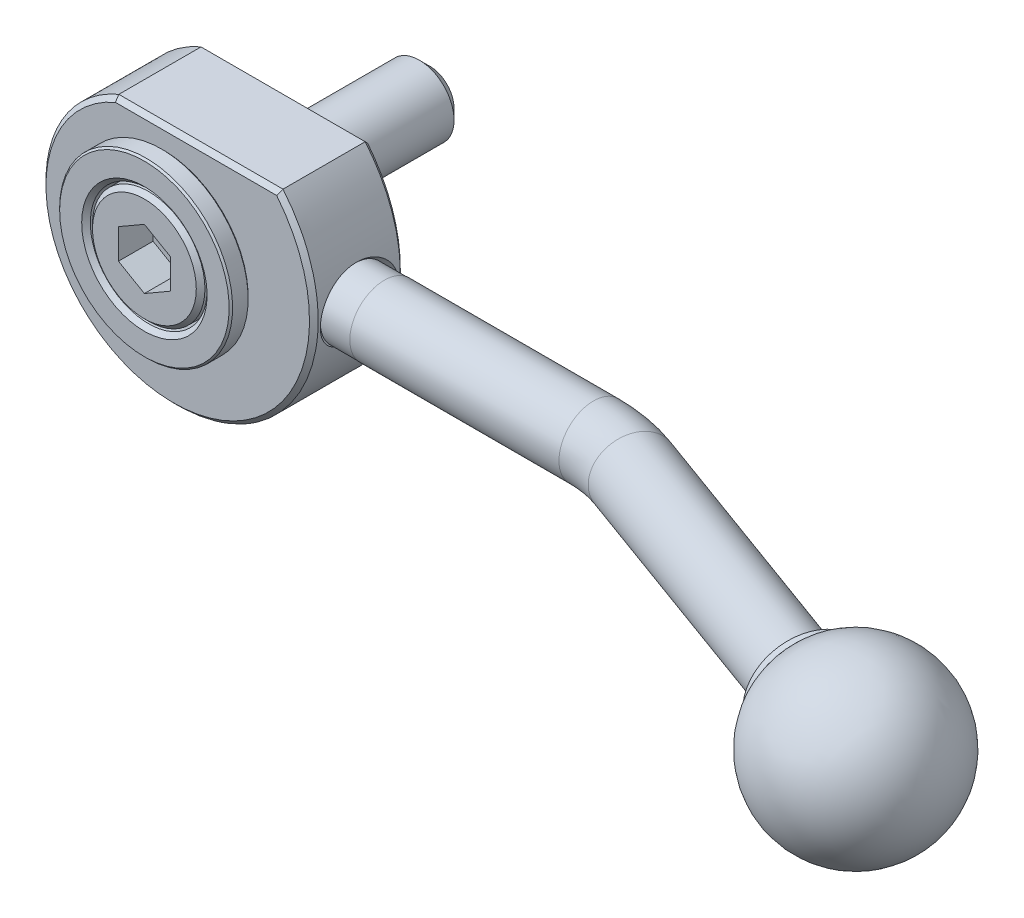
ISO-10303-21;
HEADER;
FILE_DESCRIPTION(('STEP AP214'),'2;1');
FILE_NAME('part.step','',(''),(''),'','','');
FILE_SCHEMA(('AUTOMOTIVE_DESIGN { 1 0 10303 214 1 1 1 1 }'));
ENDSEC;
DATA;
#1=APPLICATION_CONTEXT('core data for automotive mechanical design processes');
#2=APPLICATION_PROTOCOL_DEFINITION('international standard','automotive_design',2000,#1);
#3=PRODUCT_CONTEXT('',#1,'mechanical');
#4=PRODUCT('Part','Part','',(#3));
#5=PRODUCT_RELATED_PRODUCT_CATEGORY('part','',(#4));
#6=PRODUCT_DEFINITION_FORMATION('','',#4);
#7=PRODUCT_DEFINITION_CONTEXT('part definition',#1,'design');
#8=PRODUCT_DEFINITION('design','',#6,#7);
#9=PRODUCT_DEFINITION_SHAPE('','',#8);
#10=(LENGTH_UNIT() NAMED_UNIT(*) SI_UNIT(.MILLI.,.METRE.));
#11=(NAMED_UNIT(*) PLANE_ANGLE_UNIT() SI_UNIT($,.RADIAN.));
#12=(NAMED_UNIT(*) SI_UNIT($,.STERADIAN.) SOLID_ANGLE_UNIT());
#13=UNCERTAINTY_MEASURE_WITH_UNIT(LENGTH_MEASURE(1.E-05),#10,'distance_accuracy_value','');
#14=(GEOMETRIC_REPRESENTATION_CONTEXT(3) GLOBAL_UNCERTAINTY_ASSIGNED_CONTEXT((#13)) GLOBAL_UNIT_ASSIGNED_CONTEXT((#10,
#11,#12)) REPRESENTATION_CONTEXT('',''));
#15=CARTESIAN_POINT('',(0.,0.,0.));
#16=DIRECTION('',(0.,0.,1.));
#17=DIRECTION('',(1.,0.,0.));
#18=AXIS2_PLACEMENT_3D('',#15,#16,#17);
#19=CARTESIAN_POINT('',(81.7686269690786,0.,19.9047453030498));
#20=DIRECTION('',(-0.939692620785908,0.,-0.34202014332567));
#21=DIRECTION('',(-0.280577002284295,0.571858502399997,0.770878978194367));
#22=AXIS2_PLACEMENT_3D('',#19,#20,#21);
#23=PLANE('',#22);
#24=CARTESIAN_POINT('',(81.7686269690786,0.,19.9047453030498));
#25=DIRECTION('',(-0.939692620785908,0.,-0.34202014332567));
#26=DIRECTION('',(0.34202014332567,0.,-0.939692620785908));
#27=AXIS2_PLACEMENT_3D('',#24,#25,#26);
#28=CIRCLE('',#27,3.8);
#29=CARTESIAN_POINT('',(83.0683035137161,0.,16.3339133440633));
#30=VERTEX_POINT('',#29);
#31=EDGE_CURVE('E9',#30,#30,#28,.T.);
#32=ORIENTED_EDGE('',*,*,#31,.F.);
#33=EDGE_LOOP('',(#32));
#34=FACE_BOUND('',#33,.T.);
#35=CARTESIAN_POINT('',(81.7686269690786,0.,19.9047453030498));
#36=DIRECTION('',(-0.939692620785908,0.,-0.34202014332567));
#37=DIRECTION('',(-0.280577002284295,0.571858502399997,0.770878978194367));
#38=AXIS2_PLACEMENT_3D('',#35,#36,#37);
#39=CIRCLE('',#38,6.);
#40=CARTESIAN_POINT('',(80.0851649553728,3.43115101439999,24.530019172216));
#41=VERTEX_POINT('',#40);
#42=EDGE_CURVE('E29',#41,#41,#39,.T.);
#43=ORIENTED_EDGE('',*,*,#42,.T.);
#44=EDGE_LOOP('',(#43));
#45=FACE_BOUND('',#44,.T.);
#46=ADVANCED_FACE('F14',(#34,#45),#23,.T.);
#47=CARTESIAN_POINT('',(81.7686269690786,0.,19.9047453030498));
#48=DIRECTION('',(-0.939692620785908,0.,-0.34202014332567));
#49=DIRECTION('',(-0.280577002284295,0.571858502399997,0.770878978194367));
#50=AXIS2_PLACEMENT_3D('',#47,#48,#49);
#51=CYLINDRICAL_SURFACE('',#50,6.);
#52=CARTESIAN_POINT('',(82.7083195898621,0.,20.2467654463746));
#53=DIRECTION('',(-0.939692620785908,0.,-0.34202014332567));
#54=DIRECTION('',(-0.280577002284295,0.571858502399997,0.770878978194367));
#55=AXIS2_PLACEMENT_3D('',#52,#53,#54);
#56=CIRCLE('',#55,6.);
#57=CARTESIAN_POINT('',(81.0248575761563,3.43115101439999,24.8720393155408));
#58=VERTEX_POINT('',#57);
#59=EDGE_CURVE('E799',#58,#58,#56,.T.);
#60=ORIENTED_EDGE('',*,*,#59,.T.);
#61=EDGE_LOOP('',(#60));
#62=FACE_BOUND('',#61,.T.);
#63=ORIENTED_EDGE('',*,*,#42,.F.);
#64=EDGE_LOOP('',(#63));
#65=FACE_BOUND('',#64,.T.);
#66=ADVANCED_FACE('F708',(#62,#65),#51,.T.);
#67=CARTESIAN_POINT('',(90.2258605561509,1.36249813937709E-12,22.9829265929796));
#68=DIRECTION('',(-0.939692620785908,0.,-0.34202014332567));
#69=DIRECTION('',(0.195587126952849,0.82035227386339,-0.537371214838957));
#70=AXIS2_PLACEMENT_3D('',#67,#68,#69);
#71=SPHERICAL_SURFACE('',#70,10.);
#72=ORIENTED_EDGE('',*,*,#59,.F.);
#73=EDGE_LOOP('',(#72));
#74=FACE_BOUND('',#73,.T.);
#75=ADVANCED_FACE('F297',(#74),#71,.T.);
#76=CARTESIAN_POINT('',(-3.,5.19615242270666,11.));
#77=DIRECTION('',(0.,0.,-1.));
#78=DIRECTION('',(-1.,0.,0.));
#79=AXIS2_PLACEMENT_3D('',#76,#77,#78);
#80=PLANE('',#79);
#81=DIRECTION('',(0.866025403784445,-0.5,0.));
#82=VECTOR('',#81,1.);
#83=CARTESIAN_POINT('',(0.,3.46410161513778,11.));
#84=LINE('',#83,#82);
#85=CARTESIAN_POINT('',(0.,3.46410161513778,11.));
#86=VERTEX_POINT('',#85);
#87=CARTESIAN_POINT('',(3.,1.73205080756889,11.));
#88=VERTEX_POINT('',#87);
#89=EDGE_CURVE('E803',#86,#88,#84,.T.);
#90=ORIENTED_EDGE('',*,*,#89,.F.);
#91=DIRECTION('',(-0.866025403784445,-0.5,0.));
#92=VECTOR('',#91,1.);
#93=CARTESIAN_POINT('',(0.,3.46410161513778,11.));
#94=LINE('',#93,#92);
#95=CARTESIAN_POINT('',(-3.,1.7320508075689,11.));
#96=VERTEX_POINT('',#95);
#97=EDGE_CURVE('E819',#86,#96,#94,.T.);
#98=ORIENTED_EDGE('',*,*,#97,.T.);
#99=DIRECTION('',(0.,-1.,0.));
#100=VECTOR('',#99,1.);
#101=CARTESIAN_POINT('',(-3.,1.7320508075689,11.));
#102=LINE('',#101,#100);
#103=CARTESIAN_POINT('',(-3.,-1.73205080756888,11.));
#104=VERTEX_POINT('',#103);
#105=EDGE_CURVE('E823',#96,#104,#102,.T.);
#106=ORIENTED_EDGE('',*,*,#105,.T.);
#107=DIRECTION('',(-0.866025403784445,0.5,0.));
#108=VECTOR('',#107,1.);
#109=CARTESIAN_POINT('',(0.,-3.46410161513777,11.));
#110=LINE('',#109,#108);
#111=CARTESIAN_POINT('',(0.,-3.46410161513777,11.));
#112=VERTEX_POINT('',#111);
#113=EDGE_CURVE('E826',#112,#104,#110,.T.);
#114=ORIENTED_EDGE('',*,*,#113,.F.);
#115=DIRECTION('',(0.866025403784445,0.5,0.));
#116=VECTOR('',#115,1.);
#117=CARTESIAN_POINT('',(0.,-3.46410161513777,11.));
#118=LINE('',#117,#116);
#119=CARTESIAN_POINT('',(3.,-1.73205080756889,11.));
#120=VERTEX_POINT('',#119);
#121=EDGE_CURVE('E829',#112,#120,#118,.T.);
#122=ORIENTED_EDGE('',*,*,#121,.T.);
#123=DIRECTION('',(0.,1.,0.));
#124=VECTOR('',#123,1.);
#125=CARTESIAN_POINT('',(3.,-1.73205080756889,11.));
#126=LINE('',#125,#124);
#127=EDGE_CURVE('E832',#120,#88,#126,.T.);
#128=ORIENTED_EDGE('',*,*,#127,.T.);
#129=EDGE_LOOP('',(#90,#98,#106,#114,#122,#128));
#130=FACE_BOUND('',#129,.T.);
#131=ADVANCED_FACE('F293',(#130),#80,.F.);
#132=CARTESIAN_POINT('',(-3.,1.7320508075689,11.));
#133=DIRECTION('',(-1.,0.,0.));
#134=DIRECTION('',(0.,-1.,0.));
#135=AXIS2_PLACEMENT_3D('',#132,#133,#134);
#136=PLANE('',#135);
#137=DIRECTION('',(0.,0.,1.));
#138=VECTOR('',#137,1.);
#139=CARTESIAN_POINT('',(-3.,1.7320508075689,11.));
#140=LINE('',#139,#138);
#141=CARTESIAN_POINT('',(-3.,1.7320508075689,15.));
#142=VERTEX_POINT('',#141);
#143=EDGE_CURVE('E839',#96,#142,#140,.T.);
#144=ORIENTED_EDGE('',*,*,#143,.T.);
#145=DIRECTION('',(0.,-1.,0.));
#146=VECTOR('',#145,1.);
#147=CARTESIAN_POINT('',(-3.,1.7320508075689,15.));
#148=LINE('',#147,#146);
#149=CARTESIAN_POINT('',(-3.,-1.73205080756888,15.));
#150=VERTEX_POINT('',#149);
#151=EDGE_CURVE('E804',#142,#150,#148,.T.);
#152=ORIENTED_EDGE('',*,*,#151,.T.);
#153=DIRECTION('',(0.,0.,1.));
#154=VECTOR('',#153,1.);
#155=CARTESIAN_POINT('',(-3.,-1.73205080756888,11.));
#156=LINE('',#155,#154);
#157=EDGE_CURVE('E841',#104,#150,#156,.T.);
#158=ORIENTED_EDGE('',*,*,#157,.F.);
#159=ORIENTED_EDGE('',*,*,#105,.F.);
#160=EDGE_LOOP('',(#144,#152,#158,#159));
#161=FACE_BOUND('',#160,.T.);
#162=ADVANCED_FACE('F296',(#161),#136,.F.);
#163=CARTESIAN_POINT('',(0.,-3.46410161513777,11.));
#164=DIRECTION('',(0.5,0.866025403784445,0.));
#165=DIRECTION('',(-0.866025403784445,0.5,0.));
#166=AXIS2_PLACEMENT_3D('',#163,#164,#165);
#167=PLANE('',#166);
#168=ORIENTED_EDGE('',*,*,#157,.T.);
#169=DIRECTION('',(-0.866025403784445,0.5,0.));
#170=VECTOR('',#169,1.);
#171=CARTESIAN_POINT('',(0.,-3.46410161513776,15.));
#172=LINE('',#171,#170);
#173=CARTESIAN_POINT('',(0.,-3.46410161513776,15.));
#174=VERTEX_POINT('',#173);
#175=EDGE_CURVE('E807',#174,#150,#172,.T.);
#176=ORIENTED_EDGE('',*,*,#175,.F.);
#177=DIRECTION('',(0.,0.,1.));
#178=VECTOR('',#177,1.);
#179=CARTESIAN_POINT('',(0.,-3.46410161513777,11.));
#180=LINE('',#179,#178);
#181=EDGE_CURVE('E843',#112,#174,#180,.T.);
#182=ORIENTED_EDGE('',*,*,#181,.F.);
#183=ORIENTED_EDGE('',*,*,#113,.T.);
#184=EDGE_LOOP('',(#168,#176,#182,#183));
#185=FACE_BOUND('',#184,.T.);
#186=ADVANCED_FACE('F311',(#185),#167,.T.);
#187=CARTESIAN_POINT('',(0.,-3.46410161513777,11.));
#188=DIRECTION('',(0.5,-0.866025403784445,0.));
#189=DIRECTION('',(0.866025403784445,0.5,0.));
#190=AXIS2_PLACEMENT_3D('',#187,#188,#189);
#191=PLANE('',#190);
#192=ORIENTED_EDGE('',*,*,#181,.T.);
#193=DIRECTION('',(0.866025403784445,0.5,0.));
#194=VECTOR('',#193,1.);
#195=CARTESIAN_POINT('',(0.,-3.46410161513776,15.));
#196=LINE('',#195,#194);
#197=CARTESIAN_POINT('',(3.,-1.73205080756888,15.));
#198=VERTEX_POINT('',#197);
#199=EDGE_CURVE('E810',#174,#198,#196,.T.);
#200=ORIENTED_EDGE('',*,*,#199,.T.);
#201=DIRECTION('',(0.,0.,1.));
#202=VECTOR('',#201,1.);
#203=CARTESIAN_POINT('',(3.,-1.73205080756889,11.));
#204=LINE('',#203,#202);
#205=EDGE_CURVE('E845',#120,#198,#204,.T.);
#206=ORIENTED_EDGE('',*,*,#205,.F.);
#207=ORIENTED_EDGE('',*,*,#121,.F.);
#208=EDGE_LOOP('',(#192,#200,#206,#207));
#209=FACE_BOUND('',#208,.T.);
#210=ADVANCED_FACE('F315',(#209),#191,.F.);
#211=CARTESIAN_POINT('',(3.,-1.73205080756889,11.));
#212=DIRECTION('',(1.,0.,0.));
#213=DIRECTION('',(0.,0.,-1.));
#214=AXIS2_PLACEMENT_3D('',#211,#212,#213);
#215=PLANE('',#214);
#216=ORIENTED_EDGE('',*,*,#205,.T.);
#217=DIRECTION('',(0.,1.,0.));
#218=VECTOR('',#217,1.);
#219=CARTESIAN_POINT('',(3.,-1.73205080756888,15.));
#220=LINE('',#219,#218);
#221=CARTESIAN_POINT('',(3.,1.73205080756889,15.));
#222=VERTEX_POINT('',#221);
#223=EDGE_CURVE('E813',#198,#222,#220,.T.);
#224=ORIENTED_EDGE('',*,*,#223,.T.);
#225=DIRECTION('',(0.,0.,1.));
#226=VECTOR('',#225,1.);
#227=CARTESIAN_POINT('',(3.,1.73205080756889,11.));
#228=LINE('',#227,#226);
#229=EDGE_CURVE('E847',#88,#222,#228,.T.);
#230=ORIENTED_EDGE('',*,*,#229,.F.);
#231=ORIENTED_EDGE('',*,*,#127,.F.);
#232=EDGE_LOOP('',(#216,#224,#230,#231));
#233=FACE_BOUND('',#232,.T.);
#234=ADVANCED_FACE('F303',(#233),#215,.F.);
#235=CARTESIAN_POINT('',(0.,3.46410161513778,11.));
#236=DIRECTION('',(-0.5,-0.866025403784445,0.));
#237=DIRECTION('',(0.866025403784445,-0.5,0.));
#238=AXIS2_PLACEMENT_3D('',#235,#236,#237);
#239=PLANE('',#238);
#240=ORIENTED_EDGE('',*,*,#229,.T.);
#241=DIRECTION('',(0.866025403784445,-0.5,0.));
#242=VECTOR('',#241,1.);
#243=CARTESIAN_POINT('',(0.,3.46410161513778,15.));
#244=LINE('',#243,#242);
#245=CARTESIAN_POINT('',(0.,3.46410161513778,15.));
#246=VERTEX_POINT('',#245);
#247=EDGE_CURVE('E816',#246,#222,#244,.T.);
#248=ORIENTED_EDGE('',*,*,#247,.F.);
#249=DIRECTION('',(0.,0.,1.));
#250=VECTOR('',#249,1.);
#251=CARTESIAN_POINT('',(0.,3.46410161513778,11.));
#252=LINE('',#251,#250);
#253=EDGE_CURVE('E822',#86,#246,#252,.T.);
#254=ORIENTED_EDGE('',*,*,#253,.F.);
#255=ORIENTED_EDGE('',*,*,#89,.T.);
#256=EDGE_LOOP('',(#240,#248,#254,#255));
#257=FACE_BOUND('',#256,.T.);
#258=ADVANCED_FACE('F300',(#257),#239,.T.);
#259=CARTESIAN_POINT('',(0.,3.46410161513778,11.));
#260=DIRECTION('',(-0.5,0.866025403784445,0.));
#261=DIRECTION('',(-0.866025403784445,-0.5,0.));
#262=AXIS2_PLACEMENT_3D('',#259,#260,#261);
#263=PLANE('',#262);
#264=ORIENTED_EDGE('',*,*,#97,.F.);
#265=ORIENTED_EDGE('',*,*,#253,.T.);
#266=DIRECTION('',(-0.866025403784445,-0.5,0.));
#267=VECTOR('',#266,1.);
#268=CARTESIAN_POINT('',(0.,3.46410161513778,15.));
#269=LINE('',#268,#267);
#270=EDGE_CURVE('E800',#246,#142,#269,.T.);
#271=ORIENTED_EDGE('',*,*,#270,.T.);
#272=ORIENTED_EDGE('',*,*,#143,.F.);
#273=EDGE_LOOP('',(#264,#265,#271,#272));
#274=FACE_BOUND('',#273,.T.);
#275=ADVANCED_FACE('F299',(#274),#263,.F.);
#276=CARTESIAN_POINT('',(0.,0.,15.));
#277=DIRECTION('',(0.,0.,1.));
#278=DIRECTION('',(1.,0.,0.));
#279=AXIS2_PLACEMENT_3D('',#276,#277,#278);
#280=PLANE('',#279);
#281=CARTESIAN_POINT('',(0.,0.,15.));
#282=DIRECTION('',(0.,0.,1.));
#283=DIRECTION('',(1.,0.,0.));
#284=AXIS2_PLACEMENT_3D('',#281,#282,#283);
#285=CIRCLE('',#284,6.);
#286=CARTESIAN_POINT('',(6.,0.,15.));
#287=VERTEX_POINT('',#286);
#288=EDGE_CURVE('E855',#287,#287,#285,.T.);
#289=ORIENTED_EDGE('',*,*,#288,.T.);
#290=EDGE_LOOP('',(#289));
#291=FACE_BOUND('',#290,.T.);
#292=ORIENTED_EDGE('',*,*,#270,.F.);
#293=ORIENTED_EDGE('',*,*,#247,.T.);
#294=ORIENTED_EDGE('',*,*,#223,.F.);
#295=ORIENTED_EDGE('',*,*,#199,.F.);
#296=ORIENTED_EDGE('',*,*,#175,.T.);
#297=ORIENTED_EDGE('',*,*,#151,.F.);
#298=EDGE_LOOP('',(#292,#293,#294,#295,#296,#297));
#299=FACE_BOUND('',#298,.T.);
#300=ADVANCED_FACE('F307',(#291,#299),#280,.T.);
#301=CARTESIAN_POINT('',(0.,0.,15.));
#302=DIRECTION('',(0.,0.,-1.));
#303=DIRECTION('',(-1.,0.,0.));
#304=AXIS2_PLACEMENT_3D('',#301,#302,#303);
#305=CONICAL_SURFACE('',#304,6.,0.785398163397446);
#306=CARTESIAN_POINT('',(0.,0.,14.5));
#307=DIRECTION('',(0.,0.,1.));
#308=DIRECTION('',(1.,0.,0.));
#309=AXIS2_PLACEMENT_3D('',#306,#307,#308);
#310=CIRCLE('',#309,6.5);
#311=CARTESIAN_POINT('',(6.5,0.,14.5));
#312=VERTEX_POINT('',#311);
#313=EDGE_CURVE('E858',#312,#312,#310,.F.);
#314=ORIENTED_EDGE('',*,*,#313,.F.);
#315=EDGE_LOOP('',(#314));
#316=FACE_BOUND('',#315,.T.);
#317=ORIENTED_EDGE('',*,*,#288,.F.);
#318=EDGE_LOOP('',(#317));
#319=FACE_BOUND('',#318,.T.);
#320=ADVANCED_FACE('F338',(#316,#319),#305,.T.);
#321=CARTESIAN_POINT('',(0.,0.,-3.));
#322=DIRECTION('',(0.,0.,1.));
#323=DIRECTION('',(1.,0.,0.));
#324=AXIS2_PLACEMENT_3D('',#321,#322,#323);
#325=CYLINDRICAL_SURFACE('',#324,6.5);
#326=ORIENTED_EDGE('',*,*,#313,.T.);
#327=EDGE_LOOP('',(#326));
#328=FACE_BOUND('',#327,.T.);
#329=CARTESIAN_POINT('',(0.,0.,7.));
#330=DIRECTION('',(0.,0.,1.));
#331=DIRECTION('',(1.,0.,0.));
#332=AXIS2_PLACEMENT_3D('',#329,#330,#331);
#333=CIRCLE('',#332,6.5);
#334=CARTESIAN_POINT('',(6.50000000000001,0.,7.));
#335=VERTEX_POINT('',#334);
#336=EDGE_CURVE('E852',#335,#335,#333,.T.);
#337=ORIENTED_EDGE('',*,*,#336,.T.);
#338=EDGE_LOOP('',(#337));
#339=FACE_BOUND('',#338,.T.);
#340=ADVANCED_FACE('F335',(#328,#339),#325,.T.);
#341=CARTESIAN_POINT('',(4.17244977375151,-0.808184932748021,7.));
#342=DIRECTION('',(0.,0.,1.));
#343=DIRECTION('',(0.981752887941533,-0.190161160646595,0.));
#344=AXIS2_PLACEMENT_3D('',#341,#342,#343);
#345=PLANE('',#344);
#346=CARTESIAN_POINT('',(0.,0.,7.));
#347=DIRECTION('',(0.,0.,-1.));
#348=DIRECTION('',(-0.981752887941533,0.190161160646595,0.));
#349=AXIS2_PLACEMENT_3D('',#346,#347,#348);
#350=CIRCLE('',#349,6.75);
#351=CARTESIAN_POINT('',(-6.62683199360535,1.28358783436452,7.));
#352=VERTEX_POINT('',#351);
#353=EDGE_CURVE('E871',#352,#352,#350,.T.);
#354=ORIENTED_EDGE('',*,*,#353,.F.);
#355=EDGE_LOOP('',(#354));
#356=FACE_BOUND('',#355,.T.);
#357=ORIENTED_EDGE('',*,*,#336,.F.);
#358=EDGE_LOOP('',(#357));
#359=FACE_BOUND('',#358,.T.);
#360=ADVANCED_FACE('F334',(#356,#359),#345,.T.);
#361=CARTESIAN_POINT('',(0.,0.,12.8));
#362=DIRECTION('',(0.,0.,-1.));
#363=DIRECTION('',(-0.981752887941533,0.190161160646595,0.));
#364=AXIS2_PLACEMENT_3D('',#361,#362,#363);
#365=CYLINDRICAL_SURFACE('',#364,6.75);
#366=CARTESIAN_POINT('',(0.,0.,14.5));
#367=DIRECTION('',(0.,0.,1.));
#368=DIRECTION('',(0.981752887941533,-0.190161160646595,0.));
#369=AXIS2_PLACEMENT_3D('',#366,#367,#368);
#370=CIRCLE('',#369,6.75);
#371=CARTESIAN_POINT('',(6.62683199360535,-1.28358783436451,14.5));
#372=VERTEX_POINT('',#371);
#373=EDGE_CURVE('E907',#372,#372,#370,.T.);
#374=ORIENTED_EDGE('',*,*,#373,.T.);
#375=EDGE_LOOP('',(#374));
#376=FACE_BOUND('',#375,.T.);
#377=ORIENTED_EDGE('',*,*,#353,.T.);
#378=EDGE_LOOP('',(#377));
#379=FACE_BOUND('',#378,.T.);
#380=ADVANCED_FACE('F290',(#376,#379),#365,.F.);
#381=CARTESIAN_POINT('',(0.,0.,-18.));
#382=DIRECTION('',(0.,0.,-1.));
#383=DIRECTION('',(-1.,0.,0.));
#384=AXIS2_PLACEMENT_3D('',#381,#382,#383);
#385=PLANE('',#384);
#386=CARTESIAN_POINT('',(0.,0.,-18.));
#387=DIRECTION('',(0.,0.,-1.));
#388=DIRECTION('',(-1.,0.,0.));
#389=AXIS2_PLACEMENT_3D('',#386,#387,#388);
#390=CIRCLE('',#389,2.8);
#391=CARTESIAN_POINT('',(-2.79999999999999,0.,-18.));
#392=VERTEX_POINT('',#391);
#393=EDGE_CURVE('E861',#392,#392,#390,.T.);
#394=ORIENTED_EDGE('',*,*,#393,.T.);
#395=EDGE_LOOP('',(#394));
#396=FACE_BOUND('',#395,.T.);
#397=ADVANCED_FACE('F283',(#396),#385,.T.);
#398=CARTESIAN_POINT('',(0.,0.,15.));
#399=DIRECTION('',(0.,0.,1.));
#400=DIRECTION('',(0.981752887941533,-0.190161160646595,0.));
#401=AXIS2_PLACEMENT_3D('',#398,#399,#400);
#402=CONICAL_SURFACE('',#401,7.25,0.785398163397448);
#403=ORIENTED_EDGE('',*,*,#373,.F.);
#404=EDGE_LOOP('',(#403));
#405=FACE_BOUND('',#404,.T.);
#406=CARTESIAN_POINT('',(0.,0.,15.));
#407=DIRECTION('',(0.,0.,1.));
#408=DIRECTION('',(0.981752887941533,-0.190161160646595,0.));
#409=AXIS2_PLACEMENT_3D('',#406,#407,#408);
#410=CIRCLE('',#409,7.25);
#411=CARTESIAN_POINT('',(7.11770843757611,-1.3786684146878,15.));
#412=VERTEX_POINT('',#411);
#413=EDGE_CURVE('E904',#412,#412,#410,.F.);
#414=ORIENTED_EDGE('',*,*,#413,.F.);
#415=EDGE_LOOP('',(#414));
#416=FACE_BOUND('',#415,.T.);
#417=ADVANCED_FACE('F289',(#405,#416),#402,.F.);
#418=CARTESIAN_POINT('',(0.,0.,-18.));
#419=DIRECTION('',(0.,0.,1.));
#420=DIRECTION('',(1.,0.,0.));
#421=AXIS2_PLACEMENT_3D('',#418,#419,#420);
#422=CONICAL_SURFACE('',#421,2.8,0.785398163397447);
#423=CARTESIAN_POINT('',(0.,0.,-16.8));
#424=DIRECTION('',(0.,0.,-1.));
#425=DIRECTION('',(-1.,0.,0.));
#426=AXIS2_PLACEMENT_3D('',#423,#424,#425);
#427=CIRCLE('',#426,4.);
#428=CARTESIAN_POINT('',(-3.99999999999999,0.,-16.8));
#429=VERTEX_POINT('',#428);
#430=EDGE_CURVE('E864',#429,#429,#427,.F.);
#431=ORIENTED_EDGE('',*,*,#430,.F.);
#432=EDGE_LOOP('',(#431));
#433=FACE_BOUND('',#432,.T.);
#434=ORIENTED_EDGE('',*,*,#393,.F.);
#435=EDGE_LOOP('',(#434));
#436=FACE_BOUND('',#435,.T.);
#437=ADVANCED_FACE('F292',(#433,#436),#422,.T.);
#438=CARTESIAN_POINT('',(0.,0.,15.));
#439=DIRECTION('',(0.,0.,1.));
#440=DIRECTION('',(0.981752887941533,-0.190161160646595,0.));
#441=AXIS2_PLACEMENT_3D('',#438,#439,#440);
#442=PLANE('',#441);
#443=ORIENTED_EDGE('',*,*,#413,.T.);
#444=EDGE_LOOP('',(#443));
#445=FACE_BOUND('',#444,.T.);
#446=CARTESIAN_POINT('',(0.,0.,15.));
#447=DIRECTION('',(0.,0.,1.));
#448=DIRECTION('',(0.981752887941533,-0.190161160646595,0.));
#449=AXIS2_PLACEMENT_3D('',#446,#447,#448);
#450=CIRCLE('',#449,9.8);
#451=CARTESIAN_POINT('',(9.62117830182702,-1.86357937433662,15.));
#452=VERTEX_POINT('',#451);
#453=EDGE_CURVE('E895',#452,#452,#450,.T.);
#454=ORIENTED_EDGE('',*,*,#453,.T.);
#455=EDGE_LOOP('',(#454));
#456=FACE_BOUND('',#455,.T.);
#457=ADVANCED_FACE('F327',(#445,#456),#442,.T.);
#458=CARTESIAN_POINT('',(0.,0.,-3.));
#459=DIRECTION('',(0.,0.,1.));
#460=DIRECTION('',(1.,0.,0.));
#461=AXIS2_PLACEMENT_3D('',#458,#459,#460);
#462=CYLINDRICAL_SURFACE('',#461,4.);
#463=ORIENTED_EDGE('',*,*,#430,.T.);
#464=EDGE_LOOP('',(#463));
#465=FACE_BOUND('',#464,.T.);
#466=CARTESIAN_POINT('',(0.,0.,7.));
#467=DIRECTION('',(0.,0.,1.));
#468=DIRECTION('',(1.,0.,0.));
#469=AXIS2_PLACEMENT_3D('',#466,#467,#468);
#470=CIRCLE('',#469,4.);
#471=CARTESIAN_POINT('',(4.00000000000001,0.,7.));
#472=VERTEX_POINT('',#471);
#473=EDGE_CURVE('E849',#472,#472,#470,.T.);
#474=ORIENTED_EDGE('',*,*,#473,.F.);
#475=EDGE_LOOP('',(#474));
#476=FACE_BOUND('',#475,.T.);
#477=ADVANCED_FACE('F323',(#465,#476),#462,.T.);
#478=CARTESIAN_POINT('',(0.,0.,15.));
#479=DIRECTION('',(0.,0.,-1.));
#480=DIRECTION('',(-0.981752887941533,0.190161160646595,0.));
#481=AXIS2_PLACEMENT_3D('',#478,#479,#480);
#482=CONICAL_SURFACE('',#481,9.8,0.785398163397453);
#483=CARTESIAN_POINT('',(0.,0.,14.8));
#484=DIRECTION('',(0.,0.,1.));
#485=DIRECTION('',(0.981752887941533,-0.190161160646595,0.));
#486=AXIS2_PLACEMENT_3D('',#483,#484,#485);
#487=CIRCLE('',#486,10.);
#488=CARTESIAN_POINT('',(9.81752887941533,-1.90161160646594,14.8));
#489=VERTEX_POINT('',#488);
#490=EDGE_CURVE('E886',#489,#489,#487,.F.);
#491=ORIENTED_EDGE('',*,*,#490,.F.);
#492=EDGE_LOOP('',(#491));
#493=FACE_BOUND('',#492,.T.);
#494=ORIENTED_EDGE('',*,*,#453,.F.);
#495=EDGE_LOOP('',(#494));
#496=FACE_BOUND('',#495,.T.);
#497=ADVANCED_FACE('F326',(#493,#496),#482,.T.);
#498=CARTESIAN_POINT('',(6.5,0.,7.));
#499=DIRECTION('',(0.,0.,-1.));
#500=DIRECTION('',(-1.,0.,0.));
#501=AXIS2_PLACEMENT_3D('',#498,#499,#500);
#502=PLANE('',#501);
#503=ORIENTED_EDGE('',*,*,#473,.T.);
#504=EDGE_LOOP('',(#503));
#505=FACE_BOUND('',#504,.T.);
#506=CARTESIAN_POINT('',(0.,0.,7.));
#507=DIRECTION('',(0.,0.,-1.));
#508=DIRECTION('',(0.,1.,0.));
#509=AXIS2_PLACEMENT_3D('',#506,#507,#508);
#510=CIRCLE('',#509,4.25);
#511=CARTESIAN_POINT('',(0.,4.25000000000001,7.));
#512=VERTEX_POINT('',#511);
#513=EDGE_CURVE('E867',#512,#512,#510,.T.);
#514=ORIENTED_EDGE('',*,*,#513,.T.);
#515=EDGE_LOOP('',(#514));
#516=FACE_BOUND('',#515,.T.);
#517=ADVANCED_FACE('F329',(#505,#516),#502,.T.);
#518=CARTESIAN_POINT('',(0.,0.,15.));
#519=DIRECTION('',(0.,0.,-1.));
#520=DIRECTION('',(-0.981752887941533,0.190161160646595,0.));
#521=AXIS2_PLACEMENT_3D('',#518,#519,#520);
#522=CYLINDRICAL_SURFACE('',#521,10.);
#523=CARTESIAN_POINT('',(0.,0.,13.));
#524=DIRECTION('',(0.,0.,1.));
#525=DIRECTION('',(0.981752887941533,-0.190161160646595,0.));
#526=AXIS2_PLACEMENT_3D('',#523,#524,#525);
#527=CIRCLE('',#526,10.);
#528=CARTESIAN_POINT('',(9.81752887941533,-1.90161160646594,13.));
#529=VERTEX_POINT('',#528);
#530=EDGE_CURVE('E889',#529,#529,#527,.T.);
#531=ORIENTED_EDGE('',*,*,#530,.T.);
#532=EDGE_LOOP('',(#531));
#533=FACE_BOUND('',#532,.T.);
#534=ORIENTED_EDGE('',*,*,#490,.T.);
#535=EDGE_LOOP('',(#534));
#536=FACE_BOUND('',#535,.T.);
#537=ADVANCED_FACE('F332',(#533,#536),#522,.T.);
#538=CARTESIAN_POINT('',(0.,0.,0.));
#539=DIRECTION('',(0.,0.,1.));
#540=DIRECTION('',(0.981752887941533,-0.190161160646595,0.));
#541=AXIS2_PLACEMENT_3D('',#538,#539,#540);
#542=CYLINDRICAL_SURFACE('',#541,4.25);
#543=CARTESIAN_POINT('',(0.,0.,0.5));
#544=DIRECTION('',(0.,0.,1.));
#545=DIRECTION('',(0.981752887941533,-0.190161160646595,0.));
#546=AXIS2_PLACEMENT_3D('',#543,#544,#545);
#547=CIRCLE('',#546,4.25);
#548=CARTESIAN_POINT('',(4.17244977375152,-0.808184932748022,0.500000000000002));
#549=VERTEX_POINT('',#548);
#550=EDGE_CURVE('E883',#549,#549,#547,.F.);
#551=ORIENTED_EDGE('',*,*,#550,.T.);
#552=EDGE_LOOP('',(#551));
#553=FACE_BOUND('',#552,.T.);
#554=ORIENTED_EDGE('',*,*,#513,.F.);
#555=EDGE_LOOP('',(#554));
#556=FACE_BOUND('',#555,.T.);
#557=ADVANCED_FACE('F355',(#553,#556),#542,.F.);
#558=CARTESIAN_POINT('',(0.,0.,13.));
#559=DIRECTION('',(0.,0.,1.));
#560=DIRECTION('',(0.981752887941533,-0.190161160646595,0.));
#561=AXIS2_PLACEMENT_3D('',#558,#559,#560);
#562=CONICAL_SURFACE('',#561,10.,0.785398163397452);
#563=CARTESIAN_POINT('',(0.,0.,12.8));
#564=DIRECTION('',(0.,0.,1.));
#565=DIRECTION('',(0.981752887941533,-0.190161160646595,0.));
#566=AXIS2_PLACEMENT_3D('',#563,#564,#565);
#567=CIRCLE('',#566,9.8);
#568=CARTESIAN_POINT('',(9.62117830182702,-1.86357937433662,12.8));
#569=VERTEX_POINT('',#568);
#570=EDGE_CURVE('E892',#569,#569,#567,.F.);
#571=ORIENTED_EDGE('',*,*,#570,.F.);
#572=EDGE_LOOP('',(#571));
#573=FACE_BOUND('',#572,.T.);
#574=ORIENTED_EDGE('',*,*,#530,.F.);
#575=EDGE_LOOP('',(#574));
#576=FACE_BOUND('',#575,.T.);
#577=ADVANCED_FACE('F359',(#573,#576),#562,.T.);
#578=CARTESIAN_POINT('',(0.,0.,0.));
#579=DIRECTION('',(0.,0.,-1.));
#580=DIRECTION('',(-0.981752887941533,0.190161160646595,0.));
#581=AXIS2_PLACEMENT_3D('',#578,#579,#580);
#582=CONICAL_SURFACE('',#581,4.75,0.785398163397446);
#583=ORIENTED_EDGE('',*,*,#550,.F.);
#584=EDGE_LOOP('',(#583));
#585=FACE_BOUND('',#584,.T.);
#586=CARTESIAN_POINT('',(0.,0.,0.));
#587=DIRECTION('',(0.,0.,1.));
#588=DIRECTION('',(0.981752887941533,-0.190161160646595,0.));
#589=AXIS2_PLACEMENT_3D('',#586,#587,#588);
#590=CIRCLE('',#589,4.75);
#591=CARTESIAN_POINT('',(4.66332621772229,-0.903265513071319,0.));
#592=VERTEX_POINT('',#591);
#593=EDGE_CURVE('E877',#592,#592,#590,.T.);
#594=ORIENTED_EDGE('',*,*,#593,.F.);
#595=EDGE_LOOP('',(#594));
#596=FACE_BOUND('',#595,.T.);
#597=ADVANCED_FACE('F361',(#585,#596),#582,.F.);
#598=CARTESIAN_POINT('',(0.,0.,12.8));
#599=DIRECTION('',(0.,0.,1.));
#600=DIRECTION('',(0.981752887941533,-0.190161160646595,0.));
#601=AXIS2_PLACEMENT_3D('',#598,#599,#600);
#602=PLANE('',#601);
#603=CARTESIAN_POINT('',(0.,0.,12.8));
#604=DIRECTION('',(0.,0.,1.));
#605=DIRECTION('',(0.981752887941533,-0.190161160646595,0.));
#606=AXIS2_PLACEMENT_3D('',#603,#604,#605);
#607=CIRCLE('',#606,9.15);
#608=CARTESIAN_POINT('',(8.98303892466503,-1.73997461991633,12.8));
#609=VERTEX_POINT('',#608);
#610=EDGE_CURVE('E898',#609,#609,#607,.T.);
#611=ORIENTED_EDGE('',*,*,#610,.T.);
#612=EDGE_LOOP('',(#611));
#613=FACE_BOUND('',#612,.T.);
#614=ORIENTED_EDGE('',*,*,#570,.T.);
#615=EDGE_LOOP('',(#614));
#616=FACE_BOUND('',#615,.T.);
#617=ADVANCED_FACE('F365',(#613,#616),#602,.F.);
#618=CARTESIAN_POINT('',(0.,0.,0.));
#619=DIRECTION('',(0.,0.,1.));
#620=DIRECTION('',(0.981752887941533,-0.190161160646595,0.));
#621=AXIS2_PLACEMENT_3D('',#618,#619,#620);
#622=PLANE('',#621);
#623=CARTESIAN_POINT('',(0.,0.,0.));
#624=DIRECTION('',(0.,0.,1.));
#625=DIRECTION('',(0.981752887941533,-0.190161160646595,0.));
#626=AXIS2_PLACEMENT_3D('',#623,#624,#625);
#627=CIRCLE('',#626,8.25);
#628=CARTESIAN_POINT('',(8.09946132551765,-1.5688295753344,0.));
#629=VERTEX_POINT('',#628);
#630=EDGE_CURVE('E880',#629,#629,#627,.F.);
#631=ORIENTED_EDGE('',*,*,#630,.T.);
#632=EDGE_LOOP('',(#631));
#633=FACE_BOUND('',#632,.T.);
#634=ORIENTED_EDGE('',*,*,#593,.T.);
#635=EDGE_LOOP('',(#634));
#636=FACE_BOUND('',#635,.T.);
#637=ADVANCED_FACE('F368',(#633,#636),#622,.F.);
#638=CARTESIAN_POINT('',(0.,0.,12.4));
#639=DIRECTION('',(0.,0.,1.));
#640=DIRECTION('',(0.981752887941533,-0.190161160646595,0.));
#641=AXIS2_PLACEMENT_3D('',#638,#639,#640);
#642=TOROIDAL_SURFACE('',#641,9.15,0.4);
#643=CARTESIAN_POINT('',(0.,0.,12.4));
#644=DIRECTION('',(0.,0.,1.));
#645=DIRECTION('',(0.981752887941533,-0.190161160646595,0.));
#646=AXIS2_PLACEMENT_3D('',#643,#644,#645);
#647=CIRCLE('',#646,8.75);
#648=CARTESIAN_POINT('',(8.59033776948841,-1.6639101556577,12.4));
#649=VERTEX_POINT('',#648);
#650=EDGE_CURVE('E901',#649,#649,#647,.F.);
#651=ORIENTED_EDGE('',*,*,#650,.F.);
#652=EDGE_LOOP('',(#651));
#653=FACE_BOUND('',#652,.T.);
#654=ORIENTED_EDGE('',*,*,#610,.F.);
#655=EDGE_LOOP('',(#654));
#656=FACE_BOUND('',#655,.T.);
#657=ADVANCED_FACE('F370',(#653,#656),#642,.F.);
#658=CARTESIAN_POINT('',(0.,0.,0.5));
#659=DIRECTION('',(0.,0.,1.));
#660=DIRECTION('',(0.981752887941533,-0.190161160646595,0.));
#661=AXIS2_PLACEMENT_3D('',#658,#659,#660);
#662=CONICAL_SURFACE('',#661,8.75,0.785398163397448);
#663=ORIENTED_EDGE('',*,*,#630,.F.);
#664=EDGE_LOOP('',(#663));
#665=FACE_BOUND('',#664,.T.);
#666=CARTESIAN_POINT('',(0.,0.,0.5));
#667=DIRECTION('',(0.,0.,1.));
#668=DIRECTION('',(0.981752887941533,-0.190161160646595,0.));
#669=AXIS2_PLACEMENT_3D('',#666,#667,#668);
#670=CIRCLE('',#669,8.75);
#671=CARTESIAN_POINT('',(8.59033776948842,-1.6639101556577,0.500000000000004));
#672=VERTEX_POINT('',#671);
#673=EDGE_CURVE('E874',#672,#672,#670,.T.);
#674=ORIENTED_EDGE('',*,*,#673,.F.);
#675=EDGE_LOOP('',(#674));
#676=FACE_BOUND('',#675,.T.);
#677=ADVANCED_FACE('F377',(#665,#676),#662,.T.);
#678=CARTESIAN_POINT('',(0.,0.,0.));
#679=DIRECTION('',(0.,0.,1.));
#680=DIRECTION('',(0.981752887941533,-0.190161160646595,0.));
#681=AXIS2_PLACEMENT_3D('',#678,#679,#680);
#682=CYLINDRICAL_SURFACE('',#681,8.75);
#683=CARTESIAN_POINT('',(0.,0.,12.));
#684=DIRECTION('',(0.,0.,1.));
#685=DIRECTION('',(-1.,0.,0.));
#686=AXIS2_PLACEMENT_3D('',#683,#684,#685);
#687=CIRCLE('',#686,8.75);
#688=CARTESIAN_POINT('',(-8.75,0.,12.));
#689=VERTEX_POINT('',#688);
#690=EDGE_CURVE('E909',#689,#689,#687,.F.);
#691=ORIENTED_EDGE('',*,*,#690,.F.);
#692=EDGE_LOOP('',(#691));
#693=FACE_BOUND('',#692,.T.);
#694=ORIENTED_EDGE('',*,*,#650,.T.);
#695=EDGE_LOOP('',(#694));
#696=FACE_BOUND('',#695,.T.);
#697=ADVANCED_FACE('F356',(#693,#696),#682,.T.);
#698=CARTESIAN_POINT('',(0.,0.,2.5));
#699=DIRECTION('',(0.,0.,-1.));
#700=DIRECTION('',(1.,0.,0.));
#701=AXIS2_PLACEMENT_3D('',#698,#699,#700);
#702=CIRCLE('',#701,8.75);
#703=CARTESIAN_POINT('',(8.75,0.,2.5));
#704=VERTEX_POINT('',#703);
#705=EDGE_CURVE('E446',#704,#704,#702,.F.);
#706=ORIENTED_EDGE('',*,*,#705,.F.);
#707=EDGE_LOOP('',(#706));
#708=FACE_BOUND('',#707,.T.);
#709=ORIENTED_EDGE('',*,*,#673,.T.);
#710=EDGE_LOOP('',(#709));
#711=FACE_BOUND('',#710,.T.);
#712=ADVANCED_FACE('F250',(#708,#711),#682,.T.);
#713=CARTESIAN_POINT('',(0.,0.,12.));
#714=DIRECTION('',(0.,0.,1.));
#715=DIRECTION('',(-1.,0.,0.));
#716=AXIS2_PLACEMENT_3D('',#713,#714,#715);
#717=CONICAL_SURFACE('',#716,8.75,0.785398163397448);
#718=CARTESIAN_POINT('',(0.,0.,12.5));
#719=DIRECTION('',(0.,0.,-1.));
#720=DIRECTION('',(1.,0.,0.));
#721=AXIS2_PLACEMENT_3D('',#718,#719,#720);
#722=CIRCLE('',#721,9.25);
#723=CARTESIAN_POINT('',(9.25,0.,12.5));
#724=VERTEX_POINT('',#723);
#725=EDGE_CURVE('E131',#724,#724,#722,.T.);
#726=ORIENTED_EDGE('',*,*,#725,.F.);
#727=EDGE_LOOP('',(#726));
#728=FACE_BOUND('',#727,.T.);
#729=ORIENTED_EDGE('',*,*,#690,.T.);
#730=EDGE_LOOP('',(#729));
#731=FACE_BOUND('',#730,.T.);
#732=ADVANCED_FACE('F16',(#728,#731),#717,.F.);
#733=CARTESIAN_POINT('',(0.,0.,2.));
#734=DIRECTION('',(0.,0.,-1.));
#735=DIRECTION('',(1.,0.,0.));
#736=AXIS2_PLACEMENT_3D('',#733,#734,#735);
#737=CONICAL_SURFACE('',#736,9.25,0.785398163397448);
#738=ORIENTED_EDGE('',*,*,#705,.T.);
#739=EDGE_LOOP('',(#738));
#740=FACE_BOUND('',#739,.T.);
#741=CARTESIAN_POINT('',(0.,0.,2.));
#742=DIRECTION('',(0.,0.,-1.));
#743=DIRECTION('',(1.,0.,0.));
#744=AXIS2_PLACEMENT_3D('',#741,#742,#743);
#745=CIRCLE('',#744,9.25);
#746=CARTESIAN_POINT('',(9.25,0.,2.));
#747=VERTEX_POINT('',#746);
#748=EDGE_CURVE('E128',#747,#747,#745,.F.);
#749=ORIENTED_EDGE('',*,*,#748,.F.);
#750=EDGE_LOOP('',(#749));
#751=FACE_BOUND('',#750,.T.);
#752=ADVANCED_FACE('F225',(#740,#751),#737,.F.);
#753=CARTESIAN_POINT('',(1.45139223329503E-13,-15.71265,12.5));
#754=DIRECTION('',(0.,0.,-1.));
#755=DIRECTION('',(1.,0.,0.));
#756=AXIS2_PLACEMENT_3D('',#753,#754,#755);
#757=PLANE('',#756);
#758=ORIENTED_EDGE('',*,*,#725,.T.);
#759=EDGE_LOOP('',(#758));
#760=FACE_BOUND('',#759,.T.);
#761=CARTESIAN_POINT('',(9.9539729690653,14.2701063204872,12.5));
#762=CARTESIAN_POINT('',(11.3064693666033,13.2228475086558,12.5));
#763=CARTESIAN_POINT('',(12.5080596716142,11.9742910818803,12.5));
#764=CARTESIAN_POINT('',(14.5057045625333,9.13287559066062,12.5));
#765=CARTESIAN_POINT('',(15.2701901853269,7.59699598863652,12.5));
#766=CARTESIAN_POINT('',(16.3255684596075,4.29066121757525,12.5));
#767=CARTESIAN_POINT('',(16.5911550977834,2.59647186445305,12.5));
#768=CARTESIAN_POINT('',(16.5902934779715,-0.881734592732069,12.5));
#769=CARTESIAN_POINT('',(16.3212985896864,-2.58192986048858,12.5));
#770=CARTESIAN_POINT('',(15.2491640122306,-5.87810605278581,12.5));
#771=CARTESIAN_POINT('',(14.4561265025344,-7.424141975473,12.5));
#772=CARTESIAN_POINT('',(12.4105374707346,-10.2042561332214,12.5));
#773=CARTESIAN_POINT('',(11.1580519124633,-11.4300471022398,12.5));
#774=CARTESIAN_POINT('',(8.33978522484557,-13.4034335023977,12.5));
#775=CARTESIAN_POINT('',(6.7494229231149,-14.1654286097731,12.5));
#776=CARTESIAN_POINT('',(3.44933808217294,-15.111622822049,12.5));
#777=CARTESIAN_POINT('',(1.6892470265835,-15.3149451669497,12.5));
#778=CARTESIAN_POINT('',(-1.77999798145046,-15.1035038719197,12.5));
#779=CARTESIAN_POINT('',(-3.4613088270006,-14.7109364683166,12.5));
#780=CARTESIAN_POINT('',(-6.66522372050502,-13.3424314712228,12.5));
#781=CARTESIAN_POINT('',(-8.10626244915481,-12.3983265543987,12.5));
#782=CARTESIAN_POINT('',(-10.6426671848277,-10.0129306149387,12.5));
#783=CARTESIAN_POINT('',(-11.667492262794,-8.62222614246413,12.5));
#784=CARTESIAN_POINT('',(-13.2026898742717,-5.50295819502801,12.5));
#785=CARTESIAN_POINT('',(-13.669868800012,-3.82849245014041,12.5));
#786=CARTESIAN_POINT('',(-13.9038297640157,-1.2413580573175,12.5));
#787=CARTESIAN_POINT('',(-13.9005504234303,-0.382211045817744,12.5));
#788=CARTESIAN_POINT('',(-13.7346057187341,1.32963858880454,12.5));
#789=CARTESIAN_POINT('',(-13.5670692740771,2.19470697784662,12.5));
#790=CARTESIAN_POINT('',(-13.080503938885,3.84731239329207,12.5));
#791=CARTESIAN_POINT('',(-12.7624130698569,4.64558476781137,12.5));
#792=CARTESIAN_POINT('',(-11.9686860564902,6.1830178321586,12.5));
#793=CARTESIAN_POINT('',(-11.490673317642,6.9203230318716,12.5));
#794=CARTESIAN_POINT('',(-9.89086617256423,8.9388939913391,12.5));
#795=CARTESIAN_POINT('',(-8.53460241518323,10.0921390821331,12.5));
#796=CARTESIAN_POINT('',(-5.53137281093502,11.7554898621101,12.5));
#797=CARTESIAN_POINT('',(-3.82495194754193,12.2967813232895,12.5));
#798=CARTESIAN_POINT('',(-2.12223337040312,12.4643288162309,12.5));
#799=B_SPLINE_CURVE_WITH_KNOTS('',3,(#761,#762,#763,#764,#765,#766,#767,#768,#769,#770,#771,
#772,#773,#774,#775,#776,#777,#778,#779,#780,#781,#782,#783,#784,#785,#786,#787,#788,#789,#790,
#791,#792,#793,#794,#795,#796,#797,#798),.UNSPECIFIED.,.F.,.F.,(4,2,2,2,2,2,2,2,2,2,2,2,2,2,2,2,
2,2,4),(0.00207426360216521,0.00720431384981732,0.0123343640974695,0.0174644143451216,
0.0225944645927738,0.0277245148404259,0.0328545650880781,0.0379846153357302,0.0431146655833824,
0.0482447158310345,0.0533747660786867,0.0585048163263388,0.063634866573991,0.0661998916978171,
0.0687649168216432,0.0713299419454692,0.0738949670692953,0.0790250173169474,0.0841550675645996),.UNSPECIFIED.);
#800=CARTESIAN_POINT('',(-5.85415741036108,11.4994981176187,12.4998081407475));
#801=VERTEX_POINT('',#800);
#802=CARTESIAN_POINT('',(12.7911102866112,11.5000249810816,12.5));
#803=VERTEX_POINT('',#802);
#804=EDGE_CURVE('E106',#801,#803,#799,.F.);
#805=ORIENTED_EDGE('',*,*,#804,.T.);
#806=DIRECTION('',(-1.,0.,0.));
#807=VECTOR('',#806,1.);
#808=CARTESIAN_POINT('',(5.82766369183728E-13,11.4999999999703,12.5));
#809=LINE('',#808,#807);
#810=EDGE_CURVE('E110',#803,#801,#809,.T.);
#811=ORIENTED_EDGE('',*,*,#810,.T.);
#812=EDGE_LOOP('',(#805,#811));
#813=FACE_BOUND('',#812,.T.);
#814=ADVANCED_FACE('F109',(#760,#813),#757,.F.);
#815=CARTESIAN_POINT('',(1.45249635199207E-13,-15.71265,2.));
#816=DIRECTION('',(0.,0.,-1.));
#817=DIRECTION('',(1.,0.,0.));
#818=AXIS2_PLACEMENT_3D('',#815,#816,#817);
#819=PLANE('',#818);
#820=ORIENTED_EDGE('',*,*,#748,.T.);
#821=EDGE_LOOP('',(#820));
#822=FACE_BOUND('',#821,.T.);
#823=CARTESIAN_POINT('',(-2.12223337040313,12.4643288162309,2.));
#824=CARTESIAN_POINT('',(-3.82495194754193,12.2967813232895,2.));
#825=CARTESIAN_POINT('',(-5.53137281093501,11.7554898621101,2.));
#826=CARTESIAN_POINT('',(-8.53460241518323,10.0921390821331,2.));
#827=CARTESIAN_POINT('',(-9.8908661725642,8.93889399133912,2.));
#828=CARTESIAN_POINT('',(-11.490673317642,6.92032303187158,2.));
#829=CARTESIAN_POINT('',(-11.9686860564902,6.1830178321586,2.));
#830=CARTESIAN_POINT('',(-12.7624130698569,4.64558476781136,2.));
#831=CARTESIAN_POINT('',(-13.080503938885,3.84731239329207,2.));
#832=CARTESIAN_POINT('',(-13.5670692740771,2.1947069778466,2.));
#833=CARTESIAN_POINT('',(-13.7346057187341,1.32963858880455,2.));
#834=CARTESIAN_POINT('',(-13.9005504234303,-0.382211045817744,2.));
#835=CARTESIAN_POINT('',(-13.9038297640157,-1.2413580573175,2.));
#836=CARTESIAN_POINT('',(-13.669868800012,-3.82849245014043,2.));
#837=CARTESIAN_POINT('',(-13.2026898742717,-5.50295819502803,2.));
#838=CARTESIAN_POINT('',(-11.667492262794,-8.62222614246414,2.));
#839=CARTESIAN_POINT('',(-10.6426671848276,-10.0129306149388,2.));
#840=CARTESIAN_POINT('',(-8.1062624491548,-12.3983265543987,2.));
#841=CARTESIAN_POINT('',(-6.66522372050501,-13.3424314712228,2.));
#842=CARTESIAN_POINT('',(-3.46130882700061,-14.7109364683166,2.));
#843=CARTESIAN_POINT('',(-1.77999798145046,-15.1035038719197,2.));
#844=CARTESIAN_POINT('',(1.68924702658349,-15.3149451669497,2.));
#845=CARTESIAN_POINT('',(3.44933808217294,-15.111622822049,2.));
#846=CARTESIAN_POINT('',(6.74942292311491,-14.1654286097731,2.));
#847=CARTESIAN_POINT('',(8.33978522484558,-13.4034335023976,2.));
#848=CARTESIAN_POINT('',(11.1580519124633,-11.4300471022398,2.));
#849=CARTESIAN_POINT('',(12.4105374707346,-10.2042561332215,2.));
#850=CARTESIAN_POINT('',(14.4561265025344,-7.42414197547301,2.));
#851=CARTESIAN_POINT('',(15.2491640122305,-5.87810605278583,2.));
#852=CARTESIAN_POINT('',(16.3212985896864,-2.58192986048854,2.));
#853=CARTESIAN_POINT('',(16.5902934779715,-0.881734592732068,2.));
#854=CARTESIAN_POINT('',(16.5911550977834,2.59647186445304,2.));
#855=CARTESIAN_POINT('',(16.3255684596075,4.29066121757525,2.));
#856=CARTESIAN_POINT('',(15.2701901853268,7.59699598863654,2.));
#857=CARTESIAN_POINT('',(14.5057045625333,9.13287559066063,2.));
#858=CARTESIAN_POINT('',(12.5080596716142,11.9742910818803,2.));
#859=CARTESIAN_POINT('',(11.3064693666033,13.2228475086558,2.));
#860=CARTESIAN_POINT('',(9.95397296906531,14.2701063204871,2.));
#861=B_SPLINE_CURVE_WITH_KNOTS('',3,(#823,#824,#825,#826,#827,#828,#829,#830,#831,#832,#833,
#834,#835,#836,#837,#838,#839,#840,#841,#842,#843,#844,#845,#846,#847,#848,#849,#850,#851,#852,
#853,#854,#855,#856,#857,#858,#859,#860),.UNSPECIFIED.,.F.,.F.,(4,2,2,2,2,2,2,2,2,2,2,2,2,2,2,2,
2,2,4),(0.00207426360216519,0.00720431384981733,0.0123343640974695,0.0148993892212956,
0.0174644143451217,0.0200294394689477,0.0225944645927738,0.0277245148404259,0.0328545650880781,
0.0379846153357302,0.0431146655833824,0.0482447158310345,0.0533747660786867,0.0585048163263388,
0.063634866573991,0.0687649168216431,0.0738949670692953,0.0790250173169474,0.0841550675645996),.UNSPECIFIED.);
#862=CARTESIAN_POINT('',(12.7911561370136,11.5000140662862,1.99998908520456));
#863=VERTEX_POINT('',#862);
#864=CARTESIAN_POINT('',(-5.8560409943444,11.4993062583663,2.));
#865=VERTEX_POINT('',#864);
#866=EDGE_CURVE('E193',#863,#865,#861,.F.);
#867=ORIENTED_EDGE('',*,*,#866,.T.);
#868=DIRECTION('',(1.,0.,0.));
#869=VECTOR('',#868,1.);
#870=CARTESIAN_POINT('',(13.0270513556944,11.4999999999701,2.));
#871=LINE('',#870,#869);
#872=EDGE_CURVE('E413',#865,#863,#871,.T.);
#873=ORIENTED_EDGE('',*,*,#872,.T.);
#874=EDGE_LOOP('',(#867,#873));
#875=FACE_BOUND('',#874,.T.);
#876=ADVANCED_FACE('F224',(#822,#875),#819,.T.);
#877=CARTESIAN_POINT('',(5.82766369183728E-13,11.4999999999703,12.5));
#878=DIRECTION('',(0.,-0.707106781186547,-0.707106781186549));
#879=DIRECTION('',(0.,-0.707106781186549,0.707106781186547));
#880=AXIS2_PLACEMENT_3D('',#877,#878,#879);
#881=PLANE('',#880);
#882=CARTESIAN_POINT('',(13.0271418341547,11.999996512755,12.0000034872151));
#883=CARTESIAN_POINT('',(13.0175404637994,11.9789956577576,12.020833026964));
#884=CARTESIAN_POINT('',(13.0079087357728,11.9580123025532,12.0416662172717));
#885=CARTESIAN_POINT('',(12.9885879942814,11.9160881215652,12.0833326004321));
#886=CARTESIAN_POINT('',(12.9788990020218,11.8951472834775,12.1041657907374));
#887=CARTESIAN_POINT('',(12.959463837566,11.8533082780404,12.1458321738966));
#888=CARTESIAN_POINT('',(12.9497176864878,11.8324100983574,12.1666653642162));
#889=CARTESIAN_POINT('',(12.9301683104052,11.7906565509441,12.2083317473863));
#890=CARTESIAN_POINT('',(12.9203651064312,11.7698011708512,12.2291649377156));
#891=CARTESIAN_POINT('',(12.9007017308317,11.7281333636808,12.2708313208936));
#892=CARTESIAN_POINT('',(12.8908415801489,11.7073209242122,12.2916645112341));
#893=CARTESIAN_POINT('',(12.8710644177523,11.6657391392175,12.3333308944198));
#894=CARTESIAN_POINT('',(12.8611474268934,11.6449697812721,12.3541640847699));
#895=CARTESIAN_POINT('',(12.8412566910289,11.6034743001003,12.3958304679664));
#896=CARTESIAN_POINT('',(12.8312829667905,11.5827481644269,12.4166636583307));
#897=CARTESIAN_POINT('',(12.8112788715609,11.5413392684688,12.4583300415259));
#898=CARTESIAN_POINT('',(12.8012485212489,11.5206564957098,12.4791632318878));
#899=CARTESIAN_POINT('',(12.7911881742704,11.4999919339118,12.5));
#900=B_SPLINE_CURVE_WITH_KNOTS('',3,(#882,#883,#884,#885,#886,#887,#888,#889,#890,#891,#892,
#893,#894,#895,#896,#897,#898,#899),.UNSPECIFIED.,.F.,.F.,(4,2,2,2,2,2,2,2,4),(0.,
0.0932942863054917,0.186555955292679,0.279785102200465,0.372981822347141,0.466146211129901,
0.559278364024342,0.652378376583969,0.745446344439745),.UNSPECIFIED.);
#901=CARTESIAN_POINT('',(13.0270965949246,11.9999982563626,12.0000017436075));
#902=VERTEX_POINT('',#901);
#903=EDGE_CURVE('E117',#803,#902,#900,.F.);
#904=ORIENTED_EDGE('',*,*,#903,.T.);
#905=DIRECTION('',(1.,0.,0.));
#906=VECTOR('',#905,1.);
#907=CARTESIAN_POINT('',(13.0270513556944,11.9999999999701,12.));
#908=LINE('',#907,#906);
#909=CARTESIAN_POINT('',(-5.95790076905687,11.9999999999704,12.));
#910=VERTEX_POINT('',#909);
#911=EDGE_CURVE('E460',#910,#902,#908,.T.);
#912=ORIENTED_EDGE('',*,*,#911,.F.);
#913=CARTESIAN_POINT('',(-5.85256980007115,11.5003837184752,12.4996162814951));
#914=CARTESIAN_POINT('',(-5.85692441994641,11.5211536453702,12.4787979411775));
#915=CARTESIAN_POINT('',(-5.86125929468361,11.5419287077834,12.4579805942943));
#916=CARTESIAN_POINT('',(-5.86988994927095,11.5834910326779,12.4163459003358));
#917=CARTESIAN_POINT('',(-5.87418572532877,11.6042782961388,12.3955285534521));
#918=CARTESIAN_POINT('',(-5.88273815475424,11.6458649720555,12.3538938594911));
#919=CARTESIAN_POINT('',(-5.88699480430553,11.6666643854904,12.3330765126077));
#920=CARTESIAN_POINT('',(-5.89546895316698,11.7082753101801,12.2914418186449));
#921=CARTESIAN_POINT('',(-5.89968644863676,11.7290868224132,12.2706244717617));
#922=CARTESIAN_POINT('',(-5.90808226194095,11.7707218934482,12.2289897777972));
#923=CARTESIAN_POINT('',(-5.91226057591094,11.7915454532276,12.2081724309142));
#924=CARTESIAN_POINT('',(-5.92057799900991,11.8332045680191,12.1665377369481));
#925=CARTESIAN_POINT('',(-5.92471710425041,11.8540401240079,12.1457203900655));
#926=CARTESIAN_POINT('',(-5.93295608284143,11.8957231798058,12.1040856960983));
#927=CARTESIAN_POINT('',(-5.93705595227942,11.9165706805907,12.0832683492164));
#928=CARTESIAN_POINT('',(-5.9452164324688,11.9582775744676,12.0416336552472));
#929=CARTESIAN_POINT('',(-5.9492770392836,11.9791369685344,12.0208163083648));
#930=CARTESIAN_POINT('',(-5.95331780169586,12.00000124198,12.));
#931=B_SPLINE_CURVE_WITH_KNOTS('',3,(#913,#914,#915,#916,#917,#918,#919,#920,#921,#922,#923,
#924,#925,#926,#927,#928,#929,#930),.UNSPECIFIED.,.F.,.F.,(4,2,2,2,2,2,2,2,4),(0.,
0.0891840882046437,0.178376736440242,0.267577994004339,0.356787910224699,0.446006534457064,
0.535233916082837,0.624470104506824,0.713715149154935),.UNSPECIFIED.);
#932=EDGE_CURVE('E100',#910,#801,#931,.F.);
#933=ORIENTED_EDGE('',*,*,#932,.T.);
#934=ORIENTED_EDGE('',*,*,#810,.F.);
#935=EDGE_LOOP('',(#904,#912,#933,#934));
#936=FACE_BOUND('',#935,.T.);
#937=ADVANCED_FACE('F127',(#936),#881,.F.);
#938=CARTESIAN_POINT('',(13.0270513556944,11.9999999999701,2.5));
#939=DIRECTION('',(0.,0.707106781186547,-0.707106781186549));
#940=DIRECTION('',(0.,-0.707106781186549,-0.707106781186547));
#941=AXIS2_PLACEMENT_3D('',#938,#939,#940);
#942=PLANE('',#941);
#943=CARTESIAN_POINT('',(12.7911881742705,11.4999919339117,2.));
#944=CARTESIAN_POINT('',(12.8012481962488,11.5206558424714,2.02083610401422));
#945=CARTESIAN_POINT('',(12.8112782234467,11.5413379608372,2.04166863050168));
#946=CARTESIAN_POINT('',(12.8312816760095,11.582745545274,2.08333368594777));
#947=CARTESIAN_POINT('',(12.8412550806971,11.603471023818,2.10416621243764));
#948=CARTESIAN_POINT('',(12.8611451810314,11.6449651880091,2.14583126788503));
#949=CARTESIAN_POINT('',(12.8710618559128,11.665733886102,2.16666379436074));
#950=CARTESIAN_POINT('',(12.8908383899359,11.7073143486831,2.20832884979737));
#951=CARTESIAN_POINT('',(12.9006982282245,11.7281261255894,2.22916137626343));
#952=CARTESIAN_POINT('',(12.9203609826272,11.7697926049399,2.27082643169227));
#953=CARTESIAN_POINT('',(12.9301638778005,11.790647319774,2.29165895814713));
#954=CARTESIAN_POINT('',(12.949712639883,11.8323995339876,2.33332401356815));
#955=CARTESIAN_POINT('',(12.9594584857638,11.8532970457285,2.35415654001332));
#956=CARTESIAN_POINT('',(12.9788930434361,11.8951347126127,2.39582159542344));
#957=CARTESIAN_POINT('',(12.9885817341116,11.9160748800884,2.41665412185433));
#958=CARTESIAN_POINT('',(13.007901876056,11.957997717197,2.45831917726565));
#959=CARTESIAN_POINT('',(13.0175333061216,11.9789803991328,2.47915170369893));
#960=CARTESIAN_POINT('',(13.027134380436,11.999980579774,2.49998057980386));
#961=B_SPLINE_CURVE_WITH_KNOTS('',3,(#943,#944,#945,#946,#947,#948,#949,#950,#951,#952,#953,
#954,#955,#956,#957,#958,#959,#960),.UNSPECIFIED.,.F.,.F.,(4,2,2,2,2,2,2,2,4),(0.,
0.0930650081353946,0.186162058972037,0.279291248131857,0.372452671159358,0.465646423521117,
0.558872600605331,0.652131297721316,0.745422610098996),.UNSPECIFIED.);
#962=CARTESIAN_POINT('',(13.0270513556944,11.9999999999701,2.49999999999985));
#963=VERTEX_POINT('',#962);
#964=EDGE_CURVE('E183',#963,#863,#961,.F.);
#965=ORIENTED_EDGE('',*,*,#964,.T.);
#966=ORIENTED_EDGE('',*,*,#872,.F.);
#967=CARTESIAN_POINT('',(-5.95331780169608,12.0000012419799,2.5));
#968=CARTESIAN_POINT('',(-5.94927703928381,11.9791369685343,2.47918369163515));
#969=CARTESIAN_POINT('',(-5.94521643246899,11.9582775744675,2.45836634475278));
#970=CARTESIAN_POINT('',(-5.93705595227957,11.9165706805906,2.41673165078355));
#971=CARTESIAN_POINT('',(-5.93295608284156,11.8957231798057,2.39591430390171));
#972=CARTESIAN_POINT('',(-5.92471710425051,11.8540401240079,2.35427960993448));
#973=CARTESIAN_POINT('',(-5.92057799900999,11.833204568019,2.33346226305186));
#974=CARTESIAN_POINT('',(-5.91226057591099,11.7915454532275,2.29182756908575));
#975=CARTESIAN_POINT('',(-5.90808226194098,11.7707218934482,2.27101022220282));
#976=CARTESIAN_POINT('',(-5.89968644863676,11.7290868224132,2.22937552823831));
#977=CARTESIAN_POINT('',(-5.89546895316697,11.7082753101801,2.20855818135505));
#978=CARTESIAN_POINT('',(-5.88699480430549,11.6666643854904,2.16692348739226));
#979=CARTESIAN_POINT('',(-5.88273815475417,11.6458649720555,2.14610614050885));
#980=CARTESIAN_POINT('',(-5.87418572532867,11.6042782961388,2.10447144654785));
#981=CARTESIAN_POINT('',(-5.86988994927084,11.5834910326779,2.0836540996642));
#982=CARTESIAN_POINT('',(-5.86125929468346,11.5419287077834,2.04201940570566));
#983=CARTESIAN_POINT('',(-5.85692441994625,11.5211536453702,2.02120205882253));
#984=CARTESIAN_POINT('',(-5.85256980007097,11.5003837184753,2.00038371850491));
#985=B_SPLINE_CURVE_WITH_KNOTS('',3,(#967,#968,#969,#970,#971,#972,#973,#974,#975,#976,#977,
#978,#979,#980,#981,#982,#983,#984),.UNSPECIFIED.,.F.,.F.,(4,2,2,2,2,2,2,2,4),(0.,
0.0892450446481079,0.17848123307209,0.26770861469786,0.356927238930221,0.446137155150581,
0.535338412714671,0.62453106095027,0.713715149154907),.UNSPECIFIED.);
#986=CARTESIAN_POINT('',(-5.95561236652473,12.0000079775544,2.50000797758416));
#987=VERTEX_POINT('',#986);
#988=EDGE_CURVE('E124',#865,#987,#985,.F.);
#989=ORIENTED_EDGE('',*,*,#988,.T.);
#990=DIRECTION('',(-1.,0.,0.));
#991=VECTOR('',#990,1.);
#992=CARTESIAN_POINT('',(-5.95790076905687,11.9999999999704,2.5));
#993=LINE('',#992,#991);
#994=EDGE_CURVE('E462',#963,#987,#993,.T.);
#995=ORIENTED_EDGE('',*,*,#994,.F.);
#996=EDGE_LOOP('',(#965,#966,#989,#995));
#997=FACE_BOUND('',#996,.T.);
#998=ADVANCED_FACE('F150',(#997),#942,.T.);
#999=CARTESIAN_POINT('',(-2.12223337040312,12.4643288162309,12.5));
#1000=CARTESIAN_POINT('',(-3.82495194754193,12.2967813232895,12.5));
#1001=CARTESIAN_POINT('',(-5.53137281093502,11.7554898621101,12.5));
#1002=CARTESIAN_POINT('',(-8.53460241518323,10.0921390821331,12.5));
#1003=CARTESIAN_POINT('',(-9.89086617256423,8.9388939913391,12.5));
#1004=CARTESIAN_POINT('',(-11.490673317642,6.9203230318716,12.5));
#1005=CARTESIAN_POINT('',(-11.9686860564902,6.1830178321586,12.5));
#1006=CARTESIAN_POINT('',(-12.7624130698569,4.64558476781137,12.5));
#1007=CARTESIAN_POINT('',(-13.080503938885,3.84731239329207,12.5));
#1008=CARTESIAN_POINT('',(-13.5670692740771,2.19470697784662,12.5));
#1009=CARTESIAN_POINT('',(-13.7346057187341,1.32963858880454,12.5));
#1010=CARTESIAN_POINT('',(-13.9005504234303,-0.382211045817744,12.5));
#1011=CARTESIAN_POINT('',(-13.9038297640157,-1.2413580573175,12.5));
#1012=CARTESIAN_POINT('',(-13.669868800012,-3.82849245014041,12.5));
#1013=CARTESIAN_POINT('',(-13.2026898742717,-5.50295819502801,12.5));
#1014=CARTESIAN_POINT('',(-11.667492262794,-8.62222614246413,12.5));
#1015=CARTESIAN_POINT('',(-10.6426671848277,-10.0129306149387,12.5));
#1016=CARTESIAN_POINT('',(-8.10626244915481,-12.3983265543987,12.5));
#1017=CARTESIAN_POINT('',(-6.66522372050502,-13.3424314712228,12.5));
#1018=CARTESIAN_POINT('',(-3.4613088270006,-14.7109364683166,12.5));
#1019=CARTESIAN_POINT('',(-1.77999798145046,-15.1035038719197,12.5));
#1020=CARTESIAN_POINT('',(1.6892470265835,-15.3149451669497,12.5));
#1021=CARTESIAN_POINT('',(3.44933808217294,-15.111622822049,12.5));
#1022=CARTESIAN_POINT('',(6.7494229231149,-14.1654286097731,12.5));
#1023=CARTESIAN_POINT('',(8.33978522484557,-13.4034335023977,12.5));
#1024=CARTESIAN_POINT('',(11.1580519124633,-11.4300471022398,12.5));
#1025=CARTESIAN_POINT('',(12.4105374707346,-10.2042561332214,12.5));
#1026=CARTESIAN_POINT('',(14.4561265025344,-7.424141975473,12.5));
#1027=CARTESIAN_POINT('',(15.2491640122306,-5.87810605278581,12.5));
#1028=CARTESIAN_POINT('',(16.3212985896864,-2.58192986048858,12.5));
#1029=CARTESIAN_POINT('',(16.5902934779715,-0.881734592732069,12.5));
#1030=CARTESIAN_POINT('',(16.5911550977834,2.59647186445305,12.5));
#1031=CARTESIAN_POINT('',(16.3255684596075,4.29066121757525,12.5));
#1032=CARTESIAN_POINT('',(15.2701901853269,7.59699598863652,12.5));
#1033=CARTESIAN_POINT('',(14.5057045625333,9.13287559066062,12.5));
#1034=CARTESIAN_POINT('',(12.5080596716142,11.9742910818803,12.5));
#1035=CARTESIAN_POINT('',(11.3064693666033,13.2228475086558,12.5));
#1036=CARTESIAN_POINT('',(9.9539729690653,14.2701063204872,12.5));
#1037=CARTESIAN_POINT('',(-2.17246977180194,12.9617987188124,12.));
#1038=CARTESIAN_POINT('',(-3.94171975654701,12.7878364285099,12.));
#1039=CARTESIAN_POINT('',(-5.71638890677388,12.2245648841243,12.));
#1040=CARTESIAN_POINT('',(-8.83406581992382,10.4978666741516,12.));
#1041=CARTESIAN_POINT('',(-10.2429388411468,9.29964510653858,12.));
#1042=CARTESIAN_POINT('',(-11.9022413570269,7.20601731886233,12.));
#1043=CARTESIAN_POINT('',(-12.3980099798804,6.44136715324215,12.));
#1044=CARTESIAN_POINT('',(-13.2215411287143,4.84620502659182,12.));
#1045=CARTESIAN_POINT('',(-13.5513499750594,4.018418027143,12.));
#1046=CARTESIAN_POINT('',(-14.0556283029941,2.30563311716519,12.));
#1047=CARTESIAN_POINT('',(-14.2292191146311,1.40936552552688,12.));
#1048=CARTESIAN_POINT('',(-14.4012361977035,-0.365089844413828,12.));
#1049=CARTESIAN_POINT('',(-14.4045860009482,-1.25550776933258,12.));
#1050=CARTESIAN_POINT('',(-14.1623356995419,-3.93445259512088,12.));
#1051=CARTESIAN_POINT('',(-13.6781973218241,-5.6690619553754,12.));
#1052=CARTESIAN_POINT('',(-12.089523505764,-8.89705809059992,12.));
#1053=CARTESIAN_POINT('',(-11.0289711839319,-10.3360017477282,12.));
#1054=CARTESIAN_POINT('',(-8.40538014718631,-12.8034017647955,12.));
#1055=CARTESIAN_POINT('',(-6.91604622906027,-13.7789969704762,12.));
#1056=CARTESIAN_POINT('',(-3.60344379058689,-15.1939276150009,12.));
#1057=CARTESIAN_POINT('',(-1.86734900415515,-15.5990685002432,12.));
#1058=CARTESIAN_POINT('',(1.71687437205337,-15.8175954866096,12.));
#1059=CARTESIAN_POINT('',(3.53395396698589,-15.6075052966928,12.));
#1060=CARTESIAN_POINT('',(6.94068390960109,-14.6307391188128,12.));
#1061=CARTESIAN_POINT('',(8.58192148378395,-13.8442755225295,12.));
#1062=CARTESIAN_POINT('',(11.4896074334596,-11.8082763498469,12.));
#1063=CARTESIAN_POINT('',(12.7814000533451,-10.5438907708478,12.));
#1064=CARTESIAN_POINT('',(14.8907171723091,-7.67716664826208,12.));
#1065=CARTESIAN_POINT('',(15.7081923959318,-6.08335830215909,12.));
#1066=CARTESIAN_POINT('',(16.8131717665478,-2.68617110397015,12.));
#1067=CARTESIAN_POINT('',(17.0902728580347,-0.934262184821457,12.));
#1068=CARTESIAN_POINT('',(17.0911756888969,2.6487593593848,12.));
#1069=CARTESIAN_POINT('',(16.8176023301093,4.39349483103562,12.));
#1070=CARTESIAN_POINT('',(15.7308907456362,7.79796676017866,12.));
#1071=CARTESIAN_POINT('',(14.9438428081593,9.37902391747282,12.));
#1072=CARTESIAN_POINT('',(12.8878653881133,12.3034406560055,12.));
#1073=CARTESIAN_POINT('',(11.6513677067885,13.5881754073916,12.));
#1074=CARTESIAN_POINT('',(10.2600226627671,14.6654967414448,12.));
#1075=B_SPLINE_SURFACE_WITH_KNOTS('',1,3,((#999,#1000,#1001,#1002,#1003,#1004,#1005,#1006,#1007,
#1008,#1009,#1010,#1011,#1012,#1013,#1014,#1015,#1016,#1017,#1018,#1019,#1020,#1021,#1022,#1023,
#1024,#1025,#1026,#1027,#1028,#1029,#1030,#1031,#1032,#1033,#1034,#1035,#1036),(#1037,#1038,
#1039,#1040,#1041,#1042,#1043,#1044,#1045,#1046,#1047,#1048,#1049,#1050,#1051,#1052,#1053,#1054,
#1055,#1056,#1057,#1058,#1059,#1060,#1061,#1062,#1063,#1064,#1065,#1066,#1067,#1068,#1069,#1070,
#1071,#1072,#1073,#1074)),.UNSPECIFIED.,.F.,.F.,.F.,(2,2),(4,2,2,2,2,2,2,2,2,2,2,2,2,2,2,2,2,2,
4),(0.,1.),(0.00207426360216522,0.00720431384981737,0.0123343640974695,0.0148993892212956,
0.0174644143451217,0.0200294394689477,0.0225944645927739,0.027724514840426,0.0328545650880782,
0.0379846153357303,0.0431146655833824,0.0482447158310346,0.0533747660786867,0.0585048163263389,
0.063634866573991,0.0687649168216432,0.0738949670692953,0.0790250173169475,0.0841550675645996),.UNSPECIFIED.);
#1076=CARTESIAN_POINT('',(13.0270513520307,12.0000000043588,12.));
#1077=CARTESIAN_POINT('',(13.6154570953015,11.2951638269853,12.));
#1078=CARTESIAN_POINT('',(14.146767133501,10.5471785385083,12.));
#1079=CARTESIAN_POINT('',(15.2074047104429,8.77762728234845,12.));
#1080=CARTESIAN_POINT('',(15.6991464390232,7.73602792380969,12.));
#1081=CARTESIAN_POINT('',(16.4667473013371,5.58752150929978,12.));
#1082=CARTESIAN_POINT('',(16.742597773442,4.48067185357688,12.));
#1083=CARTESIAN_POINT('',(17.0719669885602,2.24546327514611,12.));
#1084=CARTESIAN_POINT('',(17.1254885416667,1.11716180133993,12.));
#1085=CARTESIAN_POINT('',(17.0124614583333,-1.11716180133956,12.));
#1086=CARTESIAN_POINT('',(16.8459267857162,-2.22312868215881,12.));
#1087=CARTESIAN_POINT('',(16.3035061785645,-4.37070350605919,12.));
#1088=CARTESIAN_POINT('',(15.9276446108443,-5.4122605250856,12.));
#1089=CARTESIAN_POINT('',(14.9851682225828,-7.39224580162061,12.));
#1090=CARTESIAN_POINT('',(14.4185870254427,-8.33062937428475,12.));
#1091=CARTESIAN_POINT('',(13.1202737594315,-10.0702491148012,12.));
#1092=CARTESIAN_POINT('',(12.3885830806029,-10.8714484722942,12.));
#1093=CARTESIAN_POINT('',(10.7915262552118,-12.3086608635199,12.));
#1094=CARTESIAN_POINT('',(9.92620749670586,-12.9446462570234,12.));
#1095=CARTESIAN_POINT('',(8.09790409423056,-14.0303430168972,12.));
#1096=CARTESIAN_POINT('',(7.13497086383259,-14.4800368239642,12.));
#1097=CARTESIAN_POINT('',(5.15049235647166,-15.1796951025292,12.));
#1098=CARTESIAN_POINT('',(4.12900042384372,-15.4296525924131,12.));
#1099=CARTESIAN_POINT('',(2.06792294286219,-15.7243849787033,12.));
#1100=CARTESIAN_POINT('',(1.02839053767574,-15.7691635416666,12.));
#1101=CARTESIAN_POINT('',(-2.05678107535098,-15.5996229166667,12.));
#1102=CARTESIAN_POINT('',(-4.06725268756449,-15.0778593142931,12.));
#1103=CARTESIAN_POINT('',(-7.69916742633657,-13.3287917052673,12.));
#1104=CARTESIAN_POINT('',(-9.31931719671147,-12.1025033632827,12.));
#1105=CARTESIAN_POINT('',(-11.9426589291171,-9.15947276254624,12.));
#1106=CARTESIAN_POINT('',(-12.9450693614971,-7.44413910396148,12.));
#1107=CARTESIAN_POINT('',(-14.2085007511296,-3.80323790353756,12.));
#1108=CARTESIAN_POINT('',(-14.4693520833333,-1.87923854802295,12.));
#1109=CARTESIAN_POINT('',(-14.2432979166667,1.87923854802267,12.));
#1110=CARTESIAN_POINT('',(-13.7568358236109,3.71223748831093,12.));
#1111=CARTESIAN_POINT('',(-12.1436533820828,7.01609641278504,12.));
#1112=CARTESIAN_POINT('',(-11.017895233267,8.48579211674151,12.));
#1113=CARTESIAN_POINT('',(-8.55948016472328,10.6522520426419,12.));
#1114=CARTESIAN_POINT('',(-7.29750543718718,11.4384135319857,12.));
#1115=CARTESIAN_POINT('',(-5.95790305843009,11.999999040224,12.));
#1116=B_SPLINE_CURVE_WITH_KNOTS('',3,(#1076,#1077,#1078,#1079,#1080,#1081,#1082,#1083,#1084,
#1085,#1086,#1087,#1088,#1089,#1090,#1091,#1092,#1093,#1094,#1095,#1096,#1097,#1098,#1099,#1100,
#1101,#1102,#1103,#1104,#1105,#1106,#1107,#1108,#1109,#1110,#1111,#1112,#1113,#1114,#1115),
.UNSPECIFIED.,.F.,.F.,(4,2,2,2,2,2,2,2,2,2,2,2,2,2,2,2,2,2,2,4),(0.0733440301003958,
0.0980662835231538,0.129316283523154,0.160566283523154,0.191816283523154,0.223066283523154,
0.254316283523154,0.285566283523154,0.316816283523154,0.348066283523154,0.379316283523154,
0.410566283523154,0.441816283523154,0.504316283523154,0.566816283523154,0.629316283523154,
0.691816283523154,0.754316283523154,0.816816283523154,0.868472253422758),.UNSPECIFIED.);
#1117=EDGE_CURVE('E120',#902,#910,#1116,.T.);
#1118=ORIENTED_EDGE('',*,*,#932,.F.);
#1119=ORIENTED_EDGE('',*,*,#1117,.F.);
#1120=ORIENTED_EDGE('',*,*,#903,.F.);
#1121=ORIENTED_EDGE('',*,*,#804,.F.);
#1122=EDGE_LOOP('',(#1118,#1119,#1120,#1121));
#1123=FACE_BOUND('',#1122,.T.);
#1124=ADVANCED_FACE('F119',(#1123),#1075,.T.);
#1125=CARTESIAN_POINT('',(-2.17246977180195,12.9617987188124,2.5));
#1126=CARTESIAN_POINT('',(-3.94171975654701,12.7878364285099,2.5));
#1127=CARTESIAN_POINT('',(-5.71638890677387,12.2245648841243,2.5));
#1128=CARTESIAN_POINT('',(-8.83406581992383,10.4978666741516,2.5));
#1129=CARTESIAN_POINT('',(-10.2429388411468,9.2996451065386,2.5));
#1130=CARTESIAN_POINT('',(-11.9022413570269,7.20601731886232,2.5));
#1131=CARTESIAN_POINT('',(-12.3980099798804,6.44136715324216,2.5));
#1132=CARTESIAN_POINT('',(-13.2215411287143,4.8462050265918,2.5));
#1133=CARTESIAN_POINT('',(-13.5513499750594,4.01841802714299,2.5));
#1134=CARTESIAN_POINT('',(-14.0556283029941,2.30563311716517,2.5));
#1135=CARTESIAN_POINT('',(-14.2292191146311,1.4093655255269,2.5));
#1136=CARTESIAN_POINT('',(-14.4012361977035,-0.365089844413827,2.5));
#1137=CARTESIAN_POINT('',(-14.4045860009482,-1.25550776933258,2.5));
#1138=CARTESIAN_POINT('',(-14.1623356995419,-3.9344525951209,2.5));
#1139=CARTESIAN_POINT('',(-13.6781973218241,-5.66906195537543,2.5));
#1140=CARTESIAN_POINT('',(-12.0895235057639,-8.89705809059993,2.5));
#1141=CARTESIAN_POINT('',(-11.0289711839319,-10.3360017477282,2.5));
#1142=CARTESIAN_POINT('',(-8.4053801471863,-12.8034017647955,2.5));
#1143=CARTESIAN_POINT('',(-6.91604622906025,-13.7789969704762,2.5));
#1144=CARTESIAN_POINT('',(-3.6034437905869,-15.1939276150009,2.5));
#1145=CARTESIAN_POINT('',(-1.86734900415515,-15.5990685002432,2.5));
#1146=CARTESIAN_POINT('',(1.71687437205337,-15.8175954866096,2.5));
#1147=CARTESIAN_POINT('',(3.5339539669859,-15.6075052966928,2.5));
#1148=CARTESIAN_POINT('',(6.94068390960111,-14.6307391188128,2.5));
#1149=CARTESIAN_POINT('',(8.58192148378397,-13.8442755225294,2.5));
#1150=CARTESIAN_POINT('',(11.4896074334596,-11.8082763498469,2.5));
#1151=CARTESIAN_POINT('',(12.781400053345,-10.5438907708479,2.5));
#1152=CARTESIAN_POINT('',(14.8907171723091,-7.67716664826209,2.5));
#1153=CARTESIAN_POINT('',(15.7081923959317,-6.08335830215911,2.5));
#1154=CARTESIAN_POINT('',(16.8131717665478,-2.6861711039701,2.5));
#1155=CARTESIAN_POINT('',(17.0902728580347,-0.934262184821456,2.5));
#1156=CARTESIAN_POINT('',(17.0911756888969,2.64875935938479,2.5));
#1157=CARTESIAN_POINT('',(16.8176023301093,4.39349483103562,2.5));
#1158=CARTESIAN_POINT('',(15.7308907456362,7.79796676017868,2.5));
#1159=CARTESIAN_POINT('',(14.9438428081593,9.37902391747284,2.5));
#1160=CARTESIAN_POINT('',(12.8878653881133,12.3034406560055,2.5));
#1161=CARTESIAN_POINT('',(11.6513677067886,13.5881754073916,2.5));
#1162=CARTESIAN_POINT('',(10.2600226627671,14.6654967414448,2.5));
#1163=CARTESIAN_POINT('',(-2.12223337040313,12.4643288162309,2.));
#1164=CARTESIAN_POINT('',(-3.82495194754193,12.2967813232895,2.));
#1165=CARTESIAN_POINT('',(-5.53137281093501,11.7554898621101,2.));
#1166=CARTESIAN_POINT('',(-8.53460241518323,10.0921390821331,2.));
#1167=CARTESIAN_POINT('',(-9.8908661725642,8.93889399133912,2.));
#1168=CARTESIAN_POINT('',(-11.490673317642,6.92032303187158,2.));
#1169=CARTESIAN_POINT('',(-11.9686860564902,6.1830178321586,2.));
#1170=CARTESIAN_POINT('',(-12.7624130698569,4.64558476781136,2.));
#1171=CARTESIAN_POINT('',(-13.080503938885,3.84731239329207,2.));
#1172=CARTESIAN_POINT('',(-13.5670692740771,2.1947069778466,2.));
#1173=CARTESIAN_POINT('',(-13.7346057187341,1.32963858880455,2.));
#1174=CARTESIAN_POINT('',(-13.9005504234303,-0.382211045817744,2.));
#1175=CARTESIAN_POINT('',(-13.9038297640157,-1.2413580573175,2.));
#1176=CARTESIAN_POINT('',(-13.669868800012,-3.82849245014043,2.));
#1177=CARTESIAN_POINT('',(-13.2026898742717,-5.50295819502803,2.));
#1178=CARTESIAN_POINT('',(-11.667492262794,-8.62222614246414,2.));
#1179=CARTESIAN_POINT('',(-10.6426671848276,-10.0129306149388,2.));
#1180=CARTESIAN_POINT('',(-8.1062624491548,-12.3983265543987,2.));
#1181=CARTESIAN_POINT('',(-6.66522372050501,-13.3424314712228,2.));
#1182=CARTESIAN_POINT('',(-3.46130882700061,-14.7109364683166,2.));
#1183=CARTESIAN_POINT('',(-1.77999798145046,-15.1035038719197,2.));
#1184=CARTESIAN_POINT('',(1.68924702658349,-15.3149451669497,2.));
#1185=CARTESIAN_POINT('',(3.44933808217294,-15.111622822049,2.));
#1186=CARTESIAN_POINT('',(6.74942292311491,-14.1654286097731,2.));
#1187=CARTESIAN_POINT('',(8.33978522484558,-13.4034335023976,2.));
#1188=CARTESIAN_POINT('',(11.1580519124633,-11.4300471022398,2.));
#1189=CARTESIAN_POINT('',(12.4105374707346,-10.2042561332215,2.));
#1190=CARTESIAN_POINT('',(14.4561265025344,-7.42414197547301,2.));
#1191=CARTESIAN_POINT('',(15.2491640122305,-5.87810605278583,2.));
#1192=CARTESIAN_POINT('',(16.3212985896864,-2.58192986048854,2.));
#1193=CARTESIAN_POINT('',(16.5902934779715,-0.881734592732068,2.));
#1194=CARTESIAN_POINT('',(16.5911550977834,2.59647186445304,2.));
#1195=CARTESIAN_POINT('',(16.3255684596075,4.29066121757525,2.));
#1196=CARTESIAN_POINT('',(15.2701901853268,7.59699598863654,2.));
#1197=CARTESIAN_POINT('',(14.5057045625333,9.13287559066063,2.));
#1198=CARTESIAN_POINT('',(12.5080596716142,11.9742910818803,2.));
#1199=CARTESIAN_POINT('',(11.3064693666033,13.2228475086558,2.));
#1200=CARTESIAN_POINT('',(9.95397296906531,14.2701063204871,2.));
#1201=B_SPLINE_SURFACE_WITH_KNOTS('',1,3,((#1125,#1126,#1127,#1128,#1129,#1130,#1131,#1132,
#1133,#1134,#1135,#1136,#1137,#1138,#1139,#1140,#1141,#1142,#1143,#1144,#1145,#1146,#1147,#1148,
#1149,#1150,#1151,#1152,#1153,#1154,#1155,#1156,#1157,#1158,#1159,#1160,#1161,#1162),(#1163,
#1164,#1165,#1166,#1167,#1168,#1169,#1170,#1171,#1172,#1173,#1174,#1175,#1176,#1177,#1178,#1179,
#1180,#1181,#1182,#1183,#1184,#1185,#1186,#1187,#1188,#1189,#1190,#1191,#1192,#1193,#1194,#1195,
#1196,#1197,#1198,#1199,#1200)),.UNSPECIFIED.,.F.,.F.,.F.,(2,2),(4,2,2,2,2,2,2,2,2,2,2,2,2,2,2,
2,2,2,4),(0.,1.),(0.00207426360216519,0.00720431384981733,0.0123343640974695,0.0148993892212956,
0.0174644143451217,0.0200294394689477,0.0225944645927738,0.0277245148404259,0.0328545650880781,
0.0379846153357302,0.0431146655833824,0.0482447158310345,0.0533747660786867,0.0585048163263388,
0.063634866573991,0.0687649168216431,0.0738949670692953,0.0790250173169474,0.0841550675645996),.UNSPECIFIED.);
#1202=CARTESIAN_POINT('',(-5.95790305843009,11.999999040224,2.5));
#1203=CARTESIAN_POINT('',(-7.29750543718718,11.4384135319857,2.5));
#1204=CARTESIAN_POINT('',(-8.55948016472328,10.6522520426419,2.5));
#1205=CARTESIAN_POINT('',(-11.017895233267,8.48579211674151,2.5));
#1206=CARTESIAN_POINT('',(-12.1436533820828,7.01609641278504,2.5));
#1207=CARTESIAN_POINT('',(-13.7568358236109,3.71223748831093,2.5));
#1208=CARTESIAN_POINT('',(-14.2432979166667,1.87923854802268,2.5));
#1209=CARTESIAN_POINT('',(-14.4693520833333,-1.87923854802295,2.5));
#1210=CARTESIAN_POINT('',(-14.2085007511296,-3.80323790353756,2.5));
#1211=CARTESIAN_POINT('',(-12.9450693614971,-7.44413910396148,2.5));
#1212=CARTESIAN_POINT('',(-11.9426589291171,-9.15947276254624,2.5));
#1213=CARTESIAN_POINT('',(-9.31931719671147,-12.1025033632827,2.5));
#1214=CARTESIAN_POINT('',(-7.69916742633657,-13.3287917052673,2.5));
#1215=CARTESIAN_POINT('',(-4.06725268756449,-15.077859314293,2.5));
#1216=CARTESIAN_POINT('',(-2.05678107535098,-15.5996229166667,2.5));
#1217=CARTESIAN_POINT('',(1.02839053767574,-15.7691635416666,2.5));
#1218=CARTESIAN_POINT('',(2.06792294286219,-15.7243849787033,2.5));
#1219=CARTESIAN_POINT('',(4.12900042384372,-15.429652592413,2.5));
#1220=CARTESIAN_POINT('',(5.15049235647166,-15.1796951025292,2.5));
#1221=CARTESIAN_POINT('',(7.13497086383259,-14.4800368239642,2.5));
#1222=CARTESIAN_POINT('',(8.09790409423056,-14.0303430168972,2.5));
#1223=CARTESIAN_POINT('',(9.92620749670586,-12.9446462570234,2.5));
#1224=CARTESIAN_POINT('',(10.7915262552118,-12.3086608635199,2.5));
#1225=CARTESIAN_POINT('',(12.3885830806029,-10.8714484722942,2.5));
#1226=CARTESIAN_POINT('',(13.1202737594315,-10.0702491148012,2.5));
#1227=CARTESIAN_POINT('',(14.4185870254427,-8.33062937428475,2.5));
#1228=CARTESIAN_POINT('',(14.9851682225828,-7.39224580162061,2.5));
#1229=CARTESIAN_POINT('',(15.9276446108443,-5.4122605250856,2.5));
#1230=CARTESIAN_POINT('',(16.3035061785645,-4.37070350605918,2.5));
#1231=CARTESIAN_POINT('',(16.8459267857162,-2.22312868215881,2.5));
#1232=CARTESIAN_POINT('',(17.0124614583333,-1.11716180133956,2.5));
#1233=CARTESIAN_POINT('',(17.1254885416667,1.11716180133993,2.5));
#1234=CARTESIAN_POINT('',(17.0719669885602,2.24546327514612,2.5));
#1235=CARTESIAN_POINT('',(16.742597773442,4.48067185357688,2.5));
#1236=CARTESIAN_POINT('',(16.4667473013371,5.58752150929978,2.5));
#1237=CARTESIAN_POINT('',(15.6991464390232,7.73602792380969,2.5));
#1238=CARTESIAN_POINT('',(15.2074047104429,8.77762728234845,2.5));
#1239=CARTESIAN_POINT('',(14.146767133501,10.5471785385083,2.5));
#1240=CARTESIAN_POINT('',(13.6154570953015,11.2951638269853,2.5));
#1241=CARTESIAN_POINT('',(13.0270513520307,12.0000000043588,2.5));
#1242=B_SPLINE_CURVE_WITH_KNOTS('',3,(#1202,#1203,#1204,#1205,#1206,#1207,#1208,#1209,#1210,
#1211,#1212,#1213,#1214,#1215,#1216,#1217,#1218,#1219,#1220,#1221,#1222,#1223,#1224,#1225,#1226,
#1227,#1228,#1229,#1230,#1231,#1232,#1233,#1234,#1235,#1236,#1237,#1238,#1239,#1240,#1241),
.UNSPECIFIED.,.F.,.F.,(4,2,2,2,2,2,2,2,2,2,2,2,2,2,2,2,2,2,2,4),(0.0733440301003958,0.125,
0.1875,0.25,0.3125,0.375,0.4375,0.5,0.53125,0.5625,0.59375,0.625,0.65625,0.6875,0.71875,0.75,
0.78125,0.8125,0.84375,0.868472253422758),.UNSPECIFIED.);
#1243=EDGE_CURVE('E113',#987,#963,#1242,.T.);
#1244=ORIENTED_EDGE('',*,*,#988,.F.);
#1245=ORIENTED_EDGE('',*,*,#866,.F.);
#1246=ORIENTED_EDGE('',*,*,#964,.F.);
#1247=ORIENTED_EDGE('',*,*,#1243,.F.);
#1248=EDGE_LOOP('',(#1244,#1245,#1246,#1247));
#1249=FACE_BOUND('',#1248,.T.);
#1250=ADVANCED_FACE('F160',(#1249),#1201,.T.);
#1251=CARTESIAN_POINT('',(13.0270513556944,11.9999999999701,12.5));
#1252=DIRECTION('',(0.,-1.,0.));
#1253=DIRECTION('',(1.,0.,0.));
#1254=AXIS2_PLACEMENT_3D('',#1251,#1252,#1253);
#1255=PLANE('',#1254);
#1256=DIRECTION('',(0.,0.,-1.));
#1257=VECTOR('',#1256,1.);
#1258=CARTESIAN_POINT('',(13.0270513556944,11.9999999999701,12.5));
#1259=LINE('',#1258,#1257);
#1260=EDGE_CURVE('E457',#902,#963,#1259,.T.);
#1261=ORIENTED_EDGE('',*,*,#1260,.T.);
#1262=ORIENTED_EDGE('',*,*,#994,.T.);
#1263=DIRECTION('',(0.,0.,-1.));
#1264=VECTOR('',#1263,1.);
#1265=CARTESIAN_POINT('',(-5.95790076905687,11.9999999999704,12.5));
#1266=LINE('',#1265,#1264);
#1267=EDGE_CURVE('E455',#910,#987,#1266,.T.);
#1268=ORIENTED_EDGE('',*,*,#1267,.F.);
#1269=ORIENTED_EDGE('',*,*,#911,.T.);
#1270=EDGE_LOOP('',(#1261,#1262,#1268,#1269));
#1271=FACE_BOUND('',#1270,.T.);
#1272=ADVANCED_FACE('F406',(#1271),#1255,.F.);
#1273=CARTESIAN_POINT('',(-1.32322512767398E-13,13.,12.5));
#1274=CARTESIAN_POINT('',(-1.70169602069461,13.1130270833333,12.5));
#1275=CARTESIAN_POINT('',(-3.44822270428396,12.8874772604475,12.5));
#1276=CARTESIAN_POINT('',(-6.76106809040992,11.7599310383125,12.5));
#1277=CARTESIAN_POINT('',(-8.32594768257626,10.8580507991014,12.5));
#1278=CARTESIAN_POINT('',(-11.017895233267,8.48579211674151,12.5));
#1279=CARTESIAN_POINT('',(-12.1436533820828,7.01609641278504,12.5));
#1280=CARTESIAN_POINT('',(-13.7568358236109,3.71223748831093,12.5));
#1281=CARTESIAN_POINT('',(-14.2432979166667,1.87923854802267,12.5));
#1282=CARTESIAN_POINT('',(-14.4693520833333,-1.87923854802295,12.5));
#1283=CARTESIAN_POINT('',(-14.2085007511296,-3.80323790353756,12.5));
#1284=CARTESIAN_POINT('',(-12.9450693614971,-7.44413910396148,12.5));
#1285=CARTESIAN_POINT('',(-11.9426589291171,-9.15947276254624,12.5));
#1286=CARTESIAN_POINT('',(-9.31931719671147,-12.1025033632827,12.5));
#1287=CARTESIAN_POINT('',(-7.69916742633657,-13.3287917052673,12.5));
#1288=CARTESIAN_POINT('',(-4.06725268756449,-15.0778593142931,12.5));
#1289=CARTESIAN_POINT('',(-2.05678107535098,-15.5996229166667,12.5));
#1290=CARTESIAN_POINT('',(1.02839053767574,-15.7691635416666,12.5));
#1291=CARTESIAN_POINT('',(2.06792294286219,-15.7243849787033,12.5));
#1292=CARTESIAN_POINT('',(4.12900042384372,-15.4296525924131,12.5));
#1293=CARTESIAN_POINT('',(5.15049235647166,-15.1796951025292,12.5));
#1294=CARTESIAN_POINT('',(7.13497086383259,-14.4800368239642,12.5));
#1295=CARTESIAN_POINT('',(8.09790409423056,-14.0303430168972,12.5));
#1296=CARTESIAN_POINT('',(9.92620749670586,-12.9446462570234,12.5));
#1297=CARTESIAN_POINT('',(10.7915262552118,-12.3086608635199,12.5));
#1298=CARTESIAN_POINT('',(12.3885830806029,-10.8714484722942,12.5));
#1299=CARTESIAN_POINT('',(13.1202737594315,-10.0702491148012,12.5));
#1300=CARTESIAN_POINT('',(14.4185870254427,-8.33062937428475,12.5));
#1301=CARTESIAN_POINT('',(14.9851682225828,-7.39224580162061,12.5));
#1302=CARTESIAN_POINT('',(15.9276446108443,-5.4122605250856,12.5));
#1303=CARTESIAN_POINT('',(16.3035061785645,-4.37070350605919,12.5));
#1304=CARTESIAN_POINT('',(16.8459267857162,-2.22312868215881,12.5));
#1305=CARTESIAN_POINT('',(17.0124614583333,-1.11716180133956,12.5));
#1306=CARTESIAN_POINT('',(17.1254885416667,1.11716180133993,12.5));
#1307=CARTESIAN_POINT('',(17.0719669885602,2.24546327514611,12.5));
#1308=CARTESIAN_POINT('',(16.742597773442,4.48067185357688,12.5));
#1309=CARTESIAN_POINT('',(16.4667473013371,5.58752150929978,12.5));
#1310=CARTESIAN_POINT('',(15.6991464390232,7.73602792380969,12.5));
#1311=CARTESIAN_POINT('',(15.2074047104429,8.77762728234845,12.5));
#1312=CARTESIAN_POINT('',(14.0230706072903,10.7535519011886,12.5));
#1313=CARTESIAN_POINT('',(13.3304982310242,11.6878220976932,12.5));
#1314=CARTESIAN_POINT('',(11.7677443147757,13.4104204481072,12.5));
#1315=CARTESIAN_POINT('',(10.897593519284,14.1986981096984,12.5));
#1316=CARTESIAN_POINT('',(9.0103525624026,15.5956487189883,12.5));
#1317=CARTESIAN_POINT('',(7.99330286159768,16.2042778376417,12.5));
#1318=CARTESIAN_POINT('',(5.84928967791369,17.2146968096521,12.5));
#1319=CARTESIAN_POINT('',(4.72237493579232,17.6164513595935,12.5));
#1320=CARTESIAN_POINT('',(2.40066901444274,18.1935087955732,12.5));
#1321=CARTESIAN_POINT('',(1.20593306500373,18.3687864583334,12.5));
#1322=CARTESIAN_POINT('',(-1.97489621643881E-13,18.4253,12.5));
#1323=B_SPLINE_CURVE_WITH_KNOTS('',3,(#1273,#1274,#1275,#1276,#1277,#1278,#1279,#1280,#1281,
#1282,#1283,#1284,#1285,#1286,#1287,#1288,#1289,#1290,#1291,#1292,#1293,#1294,#1295,#1296,#1297,
#1298,#1299,#1300,#1301,#1302,#1303,#1304,#1305,#1306,#1307,#1308,#1309,#1310,#1311,#1312,#1313,
#1314,#1315,#1316,#1317,#1318,#1319,#1320,#1321,#1322),.UNSPECIFIED.,.F.,.F.,(4,2,2,2,2,2,2,2,2,
2,2,2,2,2,2,2,2,2,2,2,2,2,2,2,4),(0.,0.0625,0.125,0.1875,0.25,0.3125,0.375,0.4375,0.5,0.53125,
0.5625,0.59375,0.625,0.65625,0.6875,0.71875,0.75,0.78125,0.8125,0.84375,0.875,0.90625,0.9375,
0.96875,1.),.UNSPECIFIED.);
#1324=DIRECTION('',(0.,0.,-1.));
#1325=VECTOR('',#1324,1.);
#1326=SURFACE_OF_LINEAR_EXTRUSION('',#1323,#1325);
#1327=CARTESIAN_POINT('',(16.3882984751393,-3.975,7.25));
#1328=CARTESIAN_POINT('',(16.3882964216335,-3.97500302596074,7.14095444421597));
#1329=CARTESIAN_POINT('',(16.3896355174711,-3.97051177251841,7.03194195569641));
#1330=CARTESIAN_POINT('',(16.394950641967,-3.95259408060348,6.81468706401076));
#1331=CARTESIAN_POINT('',(16.3989270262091,-3.93916643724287,6.70644476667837));
#1332=CARTESIAN_POINT('',(16.4094136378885,-3.90348487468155,6.49151053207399));
#1333=CARTESIAN_POINT('',(16.4159248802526,-3.88122742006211,6.38481923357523));
#1334=CARTESIAN_POINT('',(16.431308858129,-3.8280738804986,6.17374483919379));
#1335=CARTESIAN_POINT('',(16.4401824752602,-3.79717457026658,6.06936262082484));
#1336=CARTESIAN_POINT('',(16.4600403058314,-3.72706439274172,5.86386351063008));
#1337=CARTESIAN_POINT('',(16.4710202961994,-3.68787014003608,5.76274055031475));
#1338=CARTESIAN_POINT('',(16.4948231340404,-3.6014498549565,5.56419877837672));
#1339=CARTESIAN_POINT('',(16.5076466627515,-3.55422085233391,5.46678135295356));
#1340=CARTESIAN_POINT('',(16.5484121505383,-3.40101893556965,5.18111455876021));
#1341=CARTESIAN_POINT('',(16.57867001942,-3.28345986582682,4.99924303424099));
#1342=CARTESIAN_POINT('',(16.6433245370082,-3.01756379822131,4.65311494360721));
#1343=CARTESIAN_POINT('',(16.6778057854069,-2.86853043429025,4.48941284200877));
#1344=CARTESIAN_POINT('',(16.7471680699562,-2.54543140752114,4.18894502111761));
#1345=CARTESIAN_POINT('',(16.7820491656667,-2.37136196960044,4.05218337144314));
#1346=CARTESIAN_POINT('',(16.8500291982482,-1.99810519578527,3.80625919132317));
#1347=CARTESIAN_POINT('',(16.8830643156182,-1.79841068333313,3.69784724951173));
#1348=CARTESIAN_POINT('',(16.9435686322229,-1.38276289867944,3.51636970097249));
#1349=CARTESIAN_POINT('',(16.971038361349,-1.16681117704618,3.44330072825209));
#1350=CARTESIAN_POINT('',(17.0178707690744,-0.728055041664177,3.33581891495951));
#1351=CARTESIAN_POINT('',(17.0373473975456,-0.5053993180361,3.30085005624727));
#1352=CARTESIAN_POINT('',(17.0674917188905,-0.0568023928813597,3.26905352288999));
#1353=CARTESIAN_POINT('',(17.0781610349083,0.169138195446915,3.27221881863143));
#1354=CARTESIAN_POINT('',(17.0902931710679,0.611322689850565,3.31618097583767));
#1355=CARTESIAN_POINT('',(17.0919992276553,0.827662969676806,3.35594879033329));
#1356=CARTESIAN_POINT('',(17.0876009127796,1.25075536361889,3.47054632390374));
#1357=CARTESIAN_POINT('',(17.0814965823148,1.45750752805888,3.54537585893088));
#1358=CARTESIAN_POINT('',(17.0630219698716,1.85515838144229,3.72767839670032));
#1359=CARTESIAN_POINT('',(17.0506664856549,2.04609327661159,3.83507406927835));
#1360=CARTESIAN_POINT('',(17.0217935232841,2.40756850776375,4.07953325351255));
#1361=CARTESIAN_POINT('',(17.0052755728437,2.57810652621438,4.21660013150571));
#1362=CARTESIAN_POINT('',(16.9701804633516,2.89735837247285,4.51956423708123));
#1363=CARTESIAN_POINT('',(16.9515701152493,3.04559544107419,4.68596020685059));
#1364=CARTESIAN_POINT('',(16.9152222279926,3.3122852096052,5.04121530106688));
#1365=CARTESIAN_POINT('',(16.8974847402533,3.43073615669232,5.23007574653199));
#1366=CARTESIAN_POINT('',(16.8652267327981,3.63547290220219,5.62695933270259));
#1367=CARTESIAN_POINT('',(16.8507368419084,3.72145729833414,5.83514070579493));
#1368=CARTESIAN_POINT('',(16.8272523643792,3.85713276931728,6.2633030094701));
#1369=CARTESIAN_POINT('',(16.818257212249,3.90682757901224,6.48328272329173));
#1370=CARTESIAN_POINT('',(16.8071211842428,3.96797572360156,6.925854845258));
#1371=CARTESIAN_POINT('',(16.8048958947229,3.97990009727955,7.1483800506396));
#1372=CARTESIAN_POINT('',(16.8073732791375,3.96645728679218,7.59225312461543));
#1373=CARTESIAN_POINT('',(16.8120755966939,3.94109202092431,7.81360105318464));
#1374=CARTESIAN_POINT('',(16.8276714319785,3.85428622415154,8.24671368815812));
#1375=CARTESIAN_POINT('',(16.8385070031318,3.79318316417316,8.4585483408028));
#1376=CARTESIAN_POINT('',(16.8648398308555,3.63699508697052,8.86898612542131));
#1377=CARTESIAN_POINT('',(16.880337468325,3.5419072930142,9.06758817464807));
#1378=CARTESIAN_POINT('',(16.9140658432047,3.31918968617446,9.44836180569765));
#1379=CARTESIAN_POINT('',(16.9323251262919,3.19120887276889,9.63032551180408));
#1380=CARTESIAN_POINT('',(16.9688872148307,2.90673589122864,9.97041655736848));
#1381=CARTESIAN_POINT('',(16.9871900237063,2.75024140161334,10.1285419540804));
#1382=CARTESIAN_POINT('',(17.0213738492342,2.41103695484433,10.4182515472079));
#1383=CARTESIAN_POINT('',(17.0372255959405,2.22805421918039,10.5495202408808));
#1384=CARTESIAN_POINT('',(17.0636981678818,1.84228763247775,10.7794487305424));
#1385=CARTESIAN_POINT('',(17.0743194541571,1.63950552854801,10.8781114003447));
#1386=CARTESIAN_POINT('',(17.0881720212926,1.22232550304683,11.0389250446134));
#1387=CARTESIAN_POINT('',(17.0914852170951,1.00808419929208,11.1014748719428));
#1388=CARTESIAN_POINT('',(17.0896677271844,0.572206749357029,11.1898780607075));
#1389=CARTESIAN_POINT('',(17.0845381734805,0.350571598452,11.2157363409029));
#1390=CARTESIAN_POINT('',(17.0656130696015,-0.0894965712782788,11.2299766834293));
#1391=CARTESIAN_POINT('',(17.0519754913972,-0.307915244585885,11.2190262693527));
#1392=CARTESIAN_POINT('',(17.0167740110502,-0.739382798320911,11.1616885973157));
#1393=CARTESIAN_POINT('',(16.9952098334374,-0.952431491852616,11.1153001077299));
#1394=CARTESIAN_POINT('',(16.9454415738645,-1.36866841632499,10.9883172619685));
#1395=CARTESIAN_POINT('',(16.9171978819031,-1.57178874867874,10.9075164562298));
#1396=CARTESIAN_POINT('',(16.8562787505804,-1.96157421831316,10.7141298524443));
#1397=CARTESIAN_POINT('',(16.8236026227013,-2.14823679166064,10.6015391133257));
#1398=CARTESIAN_POINT('',(16.7555017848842,-2.50541822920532,10.3440821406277));
#1399=CARTESIAN_POINT('',(16.7200257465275,-2.67533912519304,10.1984008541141));
#1400=CARTESIAN_POINT('',(16.6502905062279,-2.98860177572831,9.88033318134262));
#1401=CARTESIAN_POINT('',(16.6160316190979,-3.13193669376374,9.70793994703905));
#1402=CARTESIAN_POINT('',(16.5678152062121,-3.32468379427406,9.4317383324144));
#1403=CARTESIAN_POINT('',(16.5521768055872,-3.38555857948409,9.3360259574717));
#1404=CARTESIAN_POINT('',(16.5224471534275,-3.49899316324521,9.13958057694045));
#1405=CARTESIAN_POINT('',(16.5083553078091,-3.55155615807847,9.03884952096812));
#1406=CARTESIAN_POINT('',(16.4821018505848,-3.64791471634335,8.83311120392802));
#1407=CARTESIAN_POINT('',(16.4699390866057,-3.69171551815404,8.72810654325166));
#1408=CARTESIAN_POINT('',(16.4478689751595,-3.77020914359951,8.51455281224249));
#1409=CARTESIAN_POINT('',(16.437961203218,-3.80490368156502,8.4060044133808));
#1410=CARTESIAN_POINT('',(16.4159771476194,-3.88121850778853,8.12619981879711));
#1411=CARTESIAN_POINT('',(16.4056572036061,-3.91632492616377,7.95297933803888));
#1412=CARTESIAN_POINT('',(16.3918198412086,-3.96321215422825,7.60314347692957));
#1413=CARTESIAN_POINT('',(16.3883017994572,-3.97499510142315,7.42652840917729));
#1414=CARTESIAN_POINT('',(16.3882984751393,-3.975,7.25));
#1415=B_SPLINE_CURVE_WITH_KNOTS('',3,(#1327,#1328,#1329,#1330,#1331,#1332,#1333,#1334,#1335,
#1336,#1337,#1338,#1339,#1340,#1341,#1342,#1343,#1344,#1345,#1346,#1347,#1348,#1349,#1350,#1351,
#1352,#1353,#1354,#1355,#1356,#1357,#1358,#1359,#1360,#1361,#1362,#1363,#1364,#1365,#1366,#1367,
#1368,#1369,#1370,#1371,#1372,#1373,#1374,#1375,#1376,#1377,#1378,#1379,#1380,#1381,#1382,#1383,
#1384,#1385,#1386,#1387,#1388,#1389,#1390,#1391,#1392,#1393,#1394,#1395,#1396,#1397,#1398,#1399,
#1400,#1401,#1402,#1403,#1404,#1405,#1406,#1407,#1408,#1409,#1410,#1411,#1412,#1413,#1414),
.UNSPECIFIED.,.T.,.F.,(4,2,2,2,2,2,2,2,2,2,2,2,2,2,2,2,2,2,2,2,2,2,2,2,2,2,2,2,2,2,2,2,2,2,2,2,
2,2,2,2,2,2,2,4),(0.,0.326979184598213,0.654002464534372,0.981156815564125,1.30843342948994,
1.635060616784,1.96180881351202,2.61465164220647,3.28382582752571,3.95310102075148,
4.63862345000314,5.32408057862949,5.9993945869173,6.67458411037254,7.33135263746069,
7.98811771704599,8.64333532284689,9.29862730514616,9.96638222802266,10.6341764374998,
11.3080259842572,11.9818061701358,12.6471498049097,13.3124592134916,13.9715853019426,
14.6307652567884,15.297294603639,15.9638782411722,16.6378922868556,17.3118469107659,
17.9782080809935,18.6444799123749,19.2987346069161,19.9530120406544,20.6112712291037,
21.269632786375,21.9464185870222,22.6233781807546,22.9665410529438,23.3095716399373,
23.6523965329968,23.9951568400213,24.5245356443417,25.0538659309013),.UNSPECIFIED.);
#1416=CARTESIAN_POINT('',(16.5657247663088,-3.33235426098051,9.4170348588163));
#1417=VERTEX_POINT('',#1416);
#1418=CARTESIAN_POINT('',(16.5657247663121,-3.33235426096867,5.0829651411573));
#1419=VERTEX_POINT('',#1418);
#1420=EDGE_CURVE('E790',#1417,#1419,#1415,.T.);
#1421=ORIENTED_EDGE('',*,*,#1420,.F.);
#1422=CARTESIAN_POINT('',(16.7673714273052,4.17664666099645,7.25));
#1423=CARTESIAN_POINT('',(16.7673700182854,4.17664865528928,7.38728375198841));
#1424=CARTESIAN_POINT('',(16.7684867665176,4.17099109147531,7.52453783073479));
#1425=CARTESIAN_POINT('',(16.7729117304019,4.14838271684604,7.79812012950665));
#1426=CARTESIAN_POINT('',(16.776220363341,4.13142975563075,7.93444816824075));
#1427=CARTESIAN_POINT('',(16.7849190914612,4.08626077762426,8.20529739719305));
#1428=CARTESIAN_POINT('',(16.790311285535,4.05803340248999,8.33981662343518));
#1429=CARTESIAN_POINT('',(16.8029841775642,3.99041295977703,8.60592725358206));
#1430=CARTESIAN_POINT('',(16.8102648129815,3.95102026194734,8.73751875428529));
#1431=CARTESIAN_POINT('',(16.8264372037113,3.86127874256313,8.99656208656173));
#1432=CARTESIAN_POINT('',(16.8353262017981,3.8109486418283,9.1240205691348));
#1433=CARTESIAN_POINT('',(16.8543901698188,3.699490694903,9.37396712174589));
#1434=CARTESIAN_POINT('',(16.8645645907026,3.63836745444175,9.49645728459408));
#1435=CARTESIAN_POINT('',(16.8858152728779,3.50550813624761,9.73551995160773));
#1436=CARTESIAN_POINT('',(16.8968918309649,3.43376855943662,9.85209048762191));
#1437=CARTESIAN_POINT('',(16.9194911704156,3.2800118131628,10.0781239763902));
#1438=CARTESIAN_POINT('',(16.9310137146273,3.19800005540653,10.18759062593));
#1439=CARTESIAN_POINT('',(16.9534640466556,3.02823022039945,10.3932645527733));
#1440=CARTESIAN_POINT('',(16.9643937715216,2.94093860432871,10.4898564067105));
#1441=CARTESIAN_POINT('',(16.985755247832,2.75781256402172,10.6745509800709));
#1442=CARTESIAN_POINT('',(16.9961872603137,2.66198269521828,10.7626581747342));
#1443=CARTESIAN_POINT('',(17.0160803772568,2.46232599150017,10.9293379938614));
#1444=CARTESIAN_POINT('',(17.0255419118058,2.35850273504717,11.0079148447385));
#1445=CARTESIAN_POINT('',(17.0430200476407,2.14352542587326,11.1544940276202));
#1446=CARTESIAN_POINT('',(17.0510368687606,2.03237249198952,11.2224979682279));
#1447=CARTESIAN_POINT('',(17.0643676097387,1.81654678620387,11.3398581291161));
#1448=CARTESIAN_POINT('',(17.0698844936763,1.7125590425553,11.3904528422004));
#1449=CARTESIAN_POINT('',(17.0791257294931,1.50027943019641,11.4818117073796));
#1450=CARTESIAN_POINT('',(17.0828503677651,1.39198825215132,11.5225774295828));
#1451=CARTESIAN_POINT('',(17.0882558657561,1.17206980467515,11.5936592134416));
#1452=CARTESIAN_POINT('',(17.0899383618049,1.06044527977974,11.6239836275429));
#1453=CARTESIAN_POINT('',(17.0910760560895,0.834787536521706,11.6737581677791));
#1454=CARTESIAN_POINT('',(17.0905314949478,0.720754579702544,11.6932094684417));
#1455=CARTESIAN_POINT('',(17.0873084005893,0.505028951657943,11.7192919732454));
#1456=CARTESIAN_POINT('',(17.0848913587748,0.403481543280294,11.7271727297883));
#1457=CARTESIAN_POINT('',(17.0782205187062,0.20010985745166,11.7341851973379));
#1458=CARTESIAN_POINT('',(17.0739661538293,0.0982855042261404,11.7333142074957));
#1459=CARTESIAN_POINT('',(17.0636555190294,-0.104763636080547,11.7228555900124));
#1460=CARTESIAN_POINT('',(17.057600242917,-0.205988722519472,11.7132727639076));
#1461=CARTESIAN_POINT('',(17.0437750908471,-0.407177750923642,11.6855531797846));
#1462=CARTESIAN_POINT('',(17.0360045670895,-0.507141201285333,11.6674131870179));
#1463=CARTESIAN_POINT('',(17.0191762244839,-0.701710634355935,11.6235933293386));
#1464=CARTESIAN_POINT('',(17.0101708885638,-0.796383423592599,11.5981894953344));
#1465=CARTESIAN_POINT('',(16.9908466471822,-0.983290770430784,11.5399549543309));
#1466=CARTESIAN_POINT('',(16.9805272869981,-1.07552447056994,11.5071216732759));
#1467=CARTESIAN_POINT('',(16.9478721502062,-1.347718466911,11.3980191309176));
#1468=CARTESIAN_POINT('',(16.9238260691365,-1.5233203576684,11.3111130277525));
#1469=CARTESIAN_POINT('',(16.8711338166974,-1.87071059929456,11.1055338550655));
#1470=CARTESIAN_POINT('',(16.8422851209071,-2.04140842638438,10.9850887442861));
#1471=CARTESIAN_POINT('',(16.7834981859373,-2.36254484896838,10.719907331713));
#1472=CARTESIAN_POINT('',(16.7535594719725,-2.51297447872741,10.5751603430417));
#1473=CARTESIAN_POINT('',(16.6913406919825,-2.807547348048,10.247593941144));
#1474=CARTESIAN_POINT('',(16.6591873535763,-2.94897782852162,10.0623104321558));
#1475=CARTESIAN_POINT('',(16.5988924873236,-3.20209014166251,9.67183897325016));
#1476=CARTESIAN_POINT('',(16.5707527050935,-3.31375904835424,9.46664242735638));
#1477=CARTESIAN_POINT('',(16.5184883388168,-3.51483003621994,9.02133976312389));
#1478=CARTESIAN_POINT('',(16.4949893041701,-3.60115475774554,8.77976505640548));
#1479=CARTESIAN_POINT('',(16.4579666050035,-3.73482427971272,8.28533200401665));
#1480=CARTESIAN_POINT('',(16.4444446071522,-3.78216256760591,8.03247178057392));
#1481=CARTESIAN_POINT('',(16.4284690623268,-3.83795172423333,7.51278548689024));
#1482=CARTESIAN_POINT('',(16.4264364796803,-3.84492381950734,7.24578614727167));
#1483=CARTESIAN_POINT('',(16.4347994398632,-3.81586208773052,6.71432660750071));
#1484=CARTESIAN_POINT('',(16.4451960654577,-3.77982451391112,6.44986663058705));
#1485=CARTESIAN_POINT('',(16.4773386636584,-3.66527239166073,5.93000767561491));
#1486=CARTESIAN_POINT('',(16.4991251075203,-3.58660633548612,5.67464449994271));
#1487=CARTESIAN_POINT('',(16.5517032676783,-3.3882283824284,5.18134616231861));
#1488=CARTESIAN_POINT('',(16.582496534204,-3.26850941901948,4.94341400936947));
#1489=CARTESIAN_POINT('',(16.6495160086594,-2.99118467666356,4.49419510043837));
#1490=CARTESIAN_POINT('',(16.6856927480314,-2.83391671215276,4.28269502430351));
#1491=CARTESIAN_POINT('',(16.7412070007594,-2.57163139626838,3.98961019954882));
#1492=CARTESIAN_POINT('',(16.7599307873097,-2.47974682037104,3.8958970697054));
#1493=CARTESIAN_POINT('',(16.7972736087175,-2.28761732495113,3.71748484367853));
#1494=CARTESIAN_POINT('',(16.8158926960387,-2.18737708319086,3.63278076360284));
#1495=CARTESIAN_POINT('',(16.8513767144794,-1.98544563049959,3.47825781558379));
#1496=CARTESIAN_POINT('',(16.8682794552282,-1.88421359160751,3.40784691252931));
#1497=CARTESIAN_POINT('',(16.9010638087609,-1.67552710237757,3.27677306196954));
#1498=CARTESIAN_POINT('',(16.9169459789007,-1.56807611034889,3.21610476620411));
#1499=CARTESIAN_POINT('',(16.9472507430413,-1.34772514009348,3.1053744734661));
#1500=CARTESIAN_POINT('',(16.9616743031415,-1.23482884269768,3.05530543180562));
#1501=CARTESIAN_POINT('',(16.9886647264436,-1.00443624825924,2.96653941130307));
#1502=CARTESIAN_POINT('',(17.0012318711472,-0.886940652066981,2.92784070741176));
#1503=CARTESIAN_POINT('',(17.0227668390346,-0.662873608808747,2.86647306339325));
#1504=CARTESIAN_POINT('',(17.0319861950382,-0.556700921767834,2.84243098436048));
#1505=CARTESIAN_POINT('',(17.0485232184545,-0.342473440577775,2.80405263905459));
#1506=CARTESIAN_POINT('',(17.0558411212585,-0.234418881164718,2.78971517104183));
#1507=CARTESIAN_POINT('',(17.0684341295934,-0.0173881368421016,2.7710049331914));
#1508=CARTESIAN_POINT('',(17.0737103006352,0.091587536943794,2.76662695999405));
#1509=CARTESIAN_POINT('',(17.08215840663,0.309559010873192,2.76792375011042));
#1510=CARTESIAN_POINT('',(17.0853304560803,0.418554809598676,2.77359796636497));
#1511=CARTESIAN_POINT('',(17.0893822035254,0.625541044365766,2.79394733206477));
#1512=CARTESIAN_POINT('',(17.0904469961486,0.723615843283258,2.80774020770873));
#1513=CARTESIAN_POINT('',(17.0909071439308,0.918321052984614,2.8433996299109));
#1514=CARTESIAN_POINT('',(17.0903019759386,1.01495100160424,2.86526870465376));
#1515=CARTESIAN_POINT('',(17.087518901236,1.20604111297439,2.91682492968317));
#1516=CARTESIAN_POINT('',(17.0853415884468,1.300502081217,2.94650912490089));
#1517=CARTESIAN_POINT('',(17.0795519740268,1.48670334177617,3.01336484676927));
#1518=CARTESIAN_POINT('',(17.0759391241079,1.5784425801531,3.05053923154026));
#1519=CARTESIAN_POINT('',(17.0630890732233,1.85077495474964,3.1736649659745));
#1520=CARTESIAN_POINT('',(17.051876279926,2.02641659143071,3.27065486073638));
#1521=CARTESIAN_POINT('',(17.0258425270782,2.36059747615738,3.4899837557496));
#1522=CARTESIAN_POINT('',(17.0110205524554,2.51913189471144,3.61232988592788));
#1523=CARTESIAN_POINT('',(16.978002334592,2.83093761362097,3.89120984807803));
#1524=CARTESIAN_POINT('',(16.9596191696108,2.98226954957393,4.04988998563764));
#1525=CARTESIAN_POINT('',(16.9228021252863,3.25946779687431,4.38812811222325));
#1526=CARTESIAN_POINT('',(16.9043682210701,3.3853177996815,4.56769935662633));
#1527=CARTESIAN_POINT('',(16.8673468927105,3.62346501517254,4.96538122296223));
#1528=CARTESIAN_POINT('',(16.8490003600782,3.73238663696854,5.1855369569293));
#1529=CARTESIAN_POINT('',(16.8169662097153,3.91523607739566,5.64010647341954));
#1530=CARTESIAN_POINT('',(16.803276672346,3.98917831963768,5.87451433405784));
#1531=CARTESIAN_POINT('',(16.7844424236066,4.08896623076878,6.29915029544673));
#1532=CARTESIAN_POINT('',(16.7780789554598,4.12182340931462,6.48771807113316));
#1533=CARTESIAN_POINT('',(16.7695442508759,4.16566321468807,6.86754292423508));
#1534=CARTESIAN_POINT('',(16.7673733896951,4.17664388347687,7.058800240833));
#1535=CARTESIAN_POINT('',(16.7673714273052,4.17664666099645,7.25));
#1536=B_SPLINE_CURVE_WITH_KNOTS('',3,(#1422,#1423,#1424,#1425,#1426,#1427,#1428,#1429,#1430,
#1431,#1432,#1433,#1434,#1435,#1436,#1437,#1438,#1439,#1440,#1441,#1442,#1443,#1444,#1445,#1446,
#1447,#1448,#1449,#1450,#1451,#1452,#1453,#1454,#1455,#1456,#1457,#1458,#1459,#1460,#1461,#1462,
#1463,#1464,#1465,#1466,#1467,#1468,#1469,#1470,#1471,#1472,#1473,#1474,#1475,#1476,#1477,#1478,
#1479,#1480,#1481,#1482,#1483,#1484,#1485,#1486,#1487,#1488,#1489,#1490,#1491,#1492,#1493,#1494,
#1495,#1496,#1497,#1498,#1499,#1500,#1501,#1502,#1503,#1504,#1505,#1506,#1507,#1508,#1509,#1510,
#1511,#1512,#1513,#1514,#1515,#1516,#1517,#1518,#1519,#1520,#1521,#1522,#1523,#1524,#1525,#1526,
#1527,#1528,#1529,#1530,#1531,#1532,#1533,#1534,#1535),.UNSPECIFIED.,.T.,.F.,(4,2,2,2,2,2,2,2,2,
2,2,2,2,2,2,2,2,2,2,2,2,2,2,2,2,2,2,2,2,2,2,2,2,2,2,2,2,2,2,2,2,2,2,2,2,2,2,2,2,2,2,2,2,2,2,2,
4),(0.,0.411678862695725,0.823436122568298,1.2356092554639,1.64776874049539,2.05922823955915,
2.47051258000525,2.88193278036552,3.29313713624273,3.68455291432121,4.07576109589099,
4.46679514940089,4.85776965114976,5.20460654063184,5.55138798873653,5.89789138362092,
6.24435734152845,6.54961877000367,6.85497440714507,7.16016184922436,7.46546474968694,
7.76043241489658,8.0555024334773,8.64518825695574,9.27538015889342,9.90584992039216,
10.6088297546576,11.3121144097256,12.0814683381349,12.8509507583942,13.6484523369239,
14.4460233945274,15.2464479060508,16.0470102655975,16.8406250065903,17.2378779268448,
17.634909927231,18.007790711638,18.3804660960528,18.752893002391,19.125263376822,
19.4525699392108,19.7798359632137,20.1069309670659,20.4340081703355,20.7307937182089,
21.0276722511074,21.3244386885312,21.6213185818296,22.2214291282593,22.8217086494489,
23.4791603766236,24.1370315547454,24.872896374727,25.6084574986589,26.1817653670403,
26.7551245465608),.UNSPECIFIED.);
#1537=EDGE_CURVE('E18',#1419,#1417,#1536,.T.);
#1538=ORIENTED_EDGE('',*,*,#1537,.F.);
#1539=EDGE_LOOP('',(#1421,#1538));
#1540=FACE_BOUND('',#1539,.T.);
#1541=ORIENTED_EDGE('',*,*,#1267,.T.);
#1542=ORIENTED_EDGE('',*,*,#1243,.T.);
#1543=ORIENTED_EDGE('',*,*,#1260,.F.);
#1544=ORIENTED_EDGE('',*,*,#1117,.T.);
#1545=EDGE_LOOP('',(#1541,#1542,#1543,#1544));
#1546=FACE_BOUND('',#1545,.T.);
#1547=ADVANCED_FACE('F249',(#1540,#1546),#1326,.F.);
#1548=CARTESIAN_POINT('',(17.0907247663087,0.,7.25));
#1549=DIRECTION('',(1.,0.,0.));
#1550=DIRECTION('',(0.,1.,0.));
#1551=AXIS2_PLACEMENT_3D('',#1548,#1549,#1550);
#1552=CONICAL_SURFACE('',#1551,4.5,0.785398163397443);
#1553=ORIENTED_EDGE('',*,*,#1537,.T.);
#1554=CARTESIAN_POINT('',(16.5657247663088,0.,7.25));
#1555=DIRECTION('',(1.,0.,0.));
#1556=DIRECTION('',(0.,0.,1.));
#1557=AXIS2_PLACEMENT_3D('',#1554,#1555,#1556);
#1558=CIRCLE('',#1557,3.975);
#1559=EDGE_CURVE('E37',#1417,#1419,#1558,.F.);
#1560=ORIENTED_EDGE('',*,*,#1559,.T.);
#1561=EDGE_LOOP('',(#1553,#1560));
#1562=FACE_BOUND('',#1561,.T.);
#1563=ADVANCED_FACE('F252',(#1562),#1552,.F.);
#1564=CARTESIAN_POINT('',(10.,0.,7.25));
#1565=DIRECTION('',(-1.,0.,0.));
#1566=DIRECTION('',(0.,-1.,0.));
#1567=AXIS2_PLACEMENT_3D('',#1564,#1565,#1566);
#1568=CYLINDRICAL_SURFACE('',#1567,3.975);
#1569=ORIENTED_EDGE('',*,*,#1559,.F.);
#1570=ORIENTED_EDGE('',*,*,#1420,.T.);
#1571=EDGE_LOOP('',(#1569,#1570));
#1572=FACE_BOUND('',#1571,.T.);
#1573=CARTESIAN_POINT('',(20.,0.,7.25));
#1574=DIRECTION('',(-1.,0.,0.));
#1575=DIRECTION('',(0.,-1.,0.));
#1576=AXIS2_PLACEMENT_3D('',#1573,#1574,#1575);
#1577=CIRCLE('',#1576,3.975);
#1578=CARTESIAN_POINT('',(20.,-3.97499999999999,7.25));
#1579=VERTEX_POINT('',#1578);
#1580=EDGE_CURVE('E974',#1579,#1579,#1577,.T.);
#1581=ORIENTED_EDGE('',*,*,#1580,.T.);
#1582=EDGE_LOOP('',(#1581));
#1583=FACE_BOUND('',#1582,.T.);
#1584=ADVANCED_FACE('F268',(#1572,#1583),#1568,.T.);
#1585=CARTESIAN_POINT('',(20.,0.,11.25));
#1586=DIRECTION('',(-1.,0.,0.));
#1587=DIRECTION('',(0.,-1.,0.));
#1588=AXIS2_PLACEMENT_3D('',#1585,#1586,#1587);
#1589=PLANE('',#1588);
#1590=CARTESIAN_POINT('',(20.,0.,7.25));
#1591=DIRECTION('',(-1.,0.,0.));
#1592=DIRECTION('',(0.,-1.,0.));
#1593=AXIS2_PLACEMENT_3D('',#1590,#1591,#1592);
#1594=CIRCLE('',#1593,4.);
#1595=CARTESIAN_POINT('',(20.,-3.99999999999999,7.25));
#1596=VERTEX_POINT('',#1595);
#1597=EDGE_CURVE('E870',#1596,#1596,#1594,.T.);
#1598=ORIENTED_EDGE('',*,*,#1597,.T.);
#1599=EDGE_LOOP('',(#1598));
#1600=FACE_BOUND('',#1599,.T.);
#1601=ORIENTED_EDGE('',*,*,#1580,.F.);
#1602=EDGE_LOOP('',(#1601));
#1603=FACE_BOUND('',#1602,.T.);
#1604=ADVANCED_FACE('F258',(#1600,#1603),#1589,.T.);
#1605=CARTESIAN_POINT('',(44.1787683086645,0.,7.25));
#1606=DIRECTION('',(-1.,0.,0.));
#1607=DIRECTION('',(0.,-1.,0.));
#1608=AXIS2_PLACEMENT_3D('',#1605,#1606,#1607);
#1609=CYLINDRICAL_SURFACE('',#1608,4.);
#1610=CARTESIAN_POINT('',(44.1787683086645,0.,7.25));
#1611=DIRECTION('',(-1.,0.,0.));
#1612=DIRECTION('',(0.,-1.,0.));
#1613=AXIS2_PLACEMENT_3D('',#1610,#1611,#1612);
#1614=CIRCLE('',#1613,4.);
#1615=CARTESIAN_POINT('',(44.1787683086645,0.,3.25));
#1616=VERTEX_POINT('',#1615);
#1617=EDGE_CURVE('E978',#1616,#1616,#1614,.T.);
#1618=ORIENTED_EDGE('',*,*,#1617,.T.);
#1619=EDGE_LOOP('',(#1618));
#1620=FACE_BOUND('',#1619,.T.);
#1621=ORIENTED_EDGE('',*,*,#1597,.F.);
#1622=EDGE_LOOP('',(#1621));
#1623=FACE_BOUND('',#1622,.T.);
#1624=ADVANCED_FACE('F255',(#1620,#1623),#1609,.T.);
#1625=CARTESIAN_POINT('',(44.1787683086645,0.,23.25));
#1626=DIRECTION('',(0.,-1.,0.));
#1627=DIRECTION('',(1.,0.,0.));
#1628=AXIS2_PLACEMENT_3D('',#1625,#1626,#1627);
#1629=TOROIDAL_SURFACE('',#1628,16.,4.);
#1630=CARTESIAN_POINT('',(49.6510906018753,0.,8.21491806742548));
#1631=DIRECTION('',(-0.939692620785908,0.,-0.34202014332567));
#1632=DIRECTION('',(0.,-1.,0.));
#1633=AXIS2_PLACEMENT_3D('',#1630,#1631,#1632);
#1634=CIRCLE('',#1633,4.);
#1635=CARTESIAN_POINT('',(51.019171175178,0.,4.45614758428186));
#1636=VERTEX_POINT('',#1635);
#1637=EDGE_CURVE('E982',#1636,#1636,#1634,.T.);
#1638=CARTESIAN_POINT('',(44.1787683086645,0.,23.25));
#1639=DIRECTION('',(0.,-1.,0.));
#1640=DIRECTION('',(1.,0.,0.));
#1641=AXIS2_PLACEMENT_3D('',#1638,#1639,#1640);
#1642=CIRCLE('',#1641,20.);
#1643=EDGE_CURVE('',#1616,#1636,#1642,.T.);
#1644=ORIENTED_EDGE('',*,*,#1617,.F.);
#1645=ORIENTED_EDGE('',*,*,#1637,.T.);
#1646=ORIENTED_EDGE('',*,*,#1643,.T.);
#1647=ORIENTED_EDGE('',*,*,#1643,.F.);
#1648=EDGE_LOOP('',(#1644,#1646,#1645,#1647));
#1649=FACE_BOUND('',#1648,.T.);
#1650=ADVANCED_FACE('F257',(#1649),#1629,.T.);
#1651=CARTESIAN_POINT('',(49.6510906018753,0.,8.21491806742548));
#1652=DIRECTION('',(0.939692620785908,0.,0.342020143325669));
#1653=DIRECTION('',(-0.342020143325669,0.,0.939692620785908));
#1654=AXIS2_PLACEMENT_3D('',#1651,#1652,#1653);
#1655=CYLINDRICAL_SURFACE('',#1654,4.);
#1656=CARTESIAN_POINT('',(81.5806884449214,0.,19.8363412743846));
#1657=DIRECTION('',(-0.939692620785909,0.,-0.342020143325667));
#1658=DIRECTION('',(0.342020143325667,0.,-0.939692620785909));
#1659=AXIS2_PLACEMENT_3D('',#1656,#1657,#1658);
#1660=CIRCLE('',#1659,4.);
#1661=CARTESIAN_POINT('',(82.9487690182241,0.,16.077570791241));
#1662=VERTEX_POINT('',#1661);
#1663=EDGE_CURVE('E796',#1662,#1662,#1660,.T.);
#1664=ORIENTED_EDGE('',*,*,#1663,.T.);
#1665=EDGE_LOOP('',(#1664));
#1666=FACE_BOUND('',#1665,.T.);
#1667=ORIENTED_EDGE('',*,*,#1637,.F.);
#1668=EDGE_LOOP('',(#1667));
#1669=FACE_BOUND('',#1668,.T.);
#1670=ADVANCED_FACE('F261',(#1666,#1669),#1655,.T.);
#1671=CARTESIAN_POINT('',(81.5806884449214,0.,19.8363412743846));
#1672=DIRECTION('',(-0.939692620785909,0.,-0.342020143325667));
#1673=DIRECTION('',(0.342020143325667,0.,-0.939692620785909));
#1674=AXIS2_PLACEMENT_3D('',#1671,#1672,#1673);
#1675=CONICAL_SURFACE('',#1674,4.,0.785398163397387);
#1676=ORIENTED_EDGE('',*,*,#31,.T.);
#1677=EDGE_LOOP('',(#1676));
#1678=FACE_BOUND('',#1677,.T.);
#1679=ORIENTED_EDGE('',*,*,#1663,.F.);
#1680=EDGE_LOOP('',(#1679));
#1681=FACE_BOUND('',#1680,.T.);
#1682=ADVANCED_FACE('F271',(#1678,#1681),#1675,.T.);
#1683=CLOSED_SHELL('',(#46,#66,#75,#131,#162,#186,#210,#234,#258,#275,#300,#320,#340,#360,#380,
#397,#417,#437,#457,#477,#497,#517,#537,#557,#577,#597,#617,#637,#657,#677,#697,#712,#732,#752,
#814,#876,#937,#998,#1124,#1250,#1272,#1547,#1563,#1584,#1604,#1624,#1650,#1670,#1682));
#1684=MANIFOLD_SOLID_BREP('B1',#1683);
#1685=ADVANCED_BREP_SHAPE_REPRESENTATION('',(#18,#1684),#14);
#1686=SHAPE_DEFINITION_REPRESENTATION(#9,#1685);
ENDSEC;
END-ISO-10303-21;
